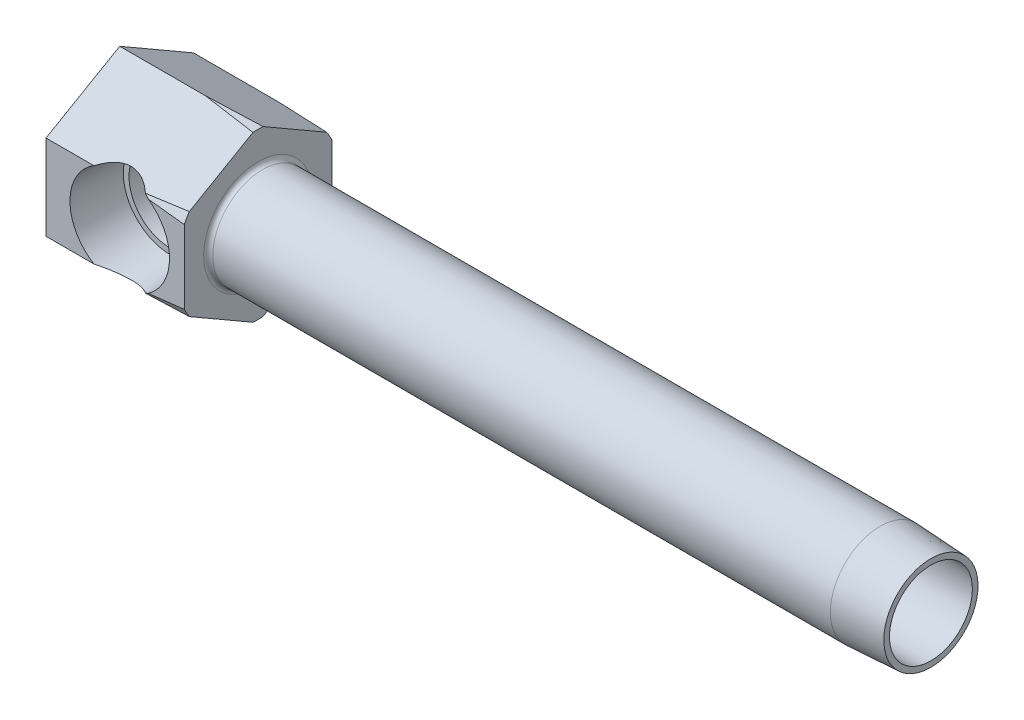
ISO-10303-21;
HEADER;
FILE_DESCRIPTION(('STEP AP214'),'2;1');
FILE_NAME('part.step','',(''),(''),'','','');
FILE_SCHEMA(('AUTOMOTIVE_DESIGN { 1 0 10303 214 1 1 1 1 }'));
ENDSEC;
DATA;
#1=APPLICATION_CONTEXT('core data for automotive mechanical design processes');
#2=APPLICATION_PROTOCOL_DEFINITION('international standard','automotive_design',2000,#1);
#3=PRODUCT_CONTEXT('',#1,'mechanical');
#4=PRODUCT('Part','Part','',(#3));
#5=PRODUCT_RELATED_PRODUCT_CATEGORY('part','',(#4));
#6=PRODUCT_DEFINITION_FORMATION('','',#4);
#7=PRODUCT_DEFINITION_CONTEXT('part definition',#1,'design');
#8=PRODUCT_DEFINITION('design','',#6,#7);
#9=PRODUCT_DEFINITION_SHAPE('','',#8);
#10=(LENGTH_UNIT() NAMED_UNIT(*) SI_UNIT(.MILLI.,.METRE.));
#11=(NAMED_UNIT(*) PLANE_ANGLE_UNIT() SI_UNIT($,.RADIAN.));
#12=(NAMED_UNIT(*) SI_UNIT($,.STERADIAN.) SOLID_ANGLE_UNIT());
#13=UNCERTAINTY_MEASURE_WITH_UNIT(LENGTH_MEASURE(1.E-05),#10,'distance_accuracy_value','');
#14=(GEOMETRIC_REPRESENTATION_CONTEXT(3) GLOBAL_UNCERTAINTY_ASSIGNED_CONTEXT((#13)) GLOBAL_UNIT_ASSIGNED_CONTEXT((#10,
#11,#12)) REPRESENTATION_CONTEXT('',''));
#15=CARTESIAN_POINT('',(0.,0.,0.));
#16=DIRECTION('',(0.,0.,1.));
#17=DIRECTION('',(1.,0.,0.));
#18=AXIS2_PLACEMENT_3D('',#15,#16,#17);
#19=CARTESIAN_POINT('',(139.7,0.,12.7));
#20=DIRECTION('',(-1.,0.,0.));
#21=DIRECTION('',(0.,-1.,0.));
#22=AXIS2_PLACEMENT_3D('',#19,#20,#21);
#23=CYLINDRICAL_SURFACE('',#22,8.5725);
#24=CARTESIAN_POINT('',(24.5999,0.,12.7));
#25=DIRECTION('',(-1.,0.,0.));
#26=DIRECTION('',(0.,-1.,0.));
#27=AXIS2_PLACEMENT_3D('',#24,#25,#26);
#28=CIRCLE('',#27,8.5725);
#29=CARTESIAN_POINT('',(24.5999,-8.57249999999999,12.7));
#30=VERTEX_POINT('',#29);
#31=EDGE_CURVE('E336',#30,#30,#28,.F.);
#32=ORIENTED_EDGE('',*,*,#31,.T.);
#33=EDGE_LOOP('',(#32));
#34=FACE_BOUND('',#33,.T.);
#35=CARTESIAN_POINT('',(130.9624,0.,12.7));
#36=DIRECTION('',(-1.,0.,0.));
#37=DIRECTION('',(0.,0.,1.));
#38=AXIS2_PLACEMENT_3D('',#35,#36,#37);
#39=CIRCLE('',#38,8.5725);
#40=CARTESIAN_POINT('',(130.9624,0.,21.2725));
#41=VERTEX_POINT('',#40);
#42=EDGE_CURVE('E451',#41,#41,#39,.T.);
#43=ORIENTED_EDGE('',*,*,#42,.T.);
#44=EDGE_LOOP('',(#43));
#45=FACE_BOUND('',#44,.T.);
#46=ADVANCED_FACE('F15',(#34,#45),#23,.T.);
#47=CARTESIAN_POINT('',(23.8125,14.6646968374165,12.7));
#48=DIRECTION('',(0.,-0.866025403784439,-0.5));
#49=DIRECTION('',(0.,0.5,-0.866025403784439));
#50=AXIS2_PLACEMENT_3D('',#47,#48,#49);
#51=PLANE('',#50);
#52=CARTESIAN_POINT('',(12.7,-0.84553451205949,39.56450873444));
#53=DIRECTION('',(0.,-0.866025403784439,-0.5));
#54=DIRECTION('',(0.,-0.5,0.866025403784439));
#55=AXIS2_PLACEMENT_3D('',#52,#53,#54);
#56=ELLIPSE('',#55,18.6296608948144,9.27637524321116);
#57=CARTESIAN_POINT('',(16.9206743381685,7.44928143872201,25.1974660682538));
#58=VERTEX_POINT('',#57);
#59=CARTESIAN_POINT('',(8.25878137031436,7.33234841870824,25.4));
#60=VERTEX_POINT('',#59);
#61=EDGE_CURVE('E274',#58,#60,#56,.F.);
#62=ORIENTED_EDGE('',*,*,#61,.F.);
#63=CARTESIAN_POINT('',(-18.0127594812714,5.8261682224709,28.0087806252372));
#64=CARTESIAN_POINT('',(-16.8306373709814,5.87521758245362,27.9238246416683));
#65=CARTESIAN_POINT('',(-15.6485840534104,5.92468080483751,27.8381518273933));
#66=CARTESIAN_POINT('',(-13.2846301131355,6.02451687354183,27.6652306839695));
#67=CARTESIAN_POINT('',(-12.1027294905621,6.07488972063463,27.5779823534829));
#68=CARTESIAN_POINT('',(-8.55724523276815,6.22749701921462,27.3136587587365));
#69=CARTESIAN_POINT('',(-6.19391632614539,6.33121869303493,27.1340075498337));
#70=CARTESIAN_POINT('',(-1.46820713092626,6.54348038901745,26.7663595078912));
#71=CARTESIAN_POINT('',(0.894173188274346,6.65202024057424,26.5783629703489));
#72=CARTESIAN_POINT('',(5.61779155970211,6.87509693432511,26.1919828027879));
#73=CARTESIAN_POINT('',(7.97902962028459,6.98963373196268,25.9935992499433));
#74=CARTESIAN_POINT('',(11.0687586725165,7.14461492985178,25.7251639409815));
#75=CARTESIAN_POINT('',(11.7979525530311,7.18156395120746,25.6611663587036));
#76=CARTESIAN_POINT('',(13.2561801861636,7.25627270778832,25.5317669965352));
#77=CARTESIAN_POINT('',(13.9852139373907,7.29403244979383,25.466365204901));
#78=CARTESIAN_POINT('',(16.2315552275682,7.41175284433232,25.2624675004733));
#79=CARTESIAN_POINT('',(17.7485574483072,7.49318264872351,25.1214269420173));
#80=CARTESIAN_POINT('',(20.0232678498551,7.61884388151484,24.903775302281));
#81=CARTESIAN_POINT('',(20.7813654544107,7.661316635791,24.8302103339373));
#82=CARTESIAN_POINT('',(22.2972664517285,7.74757966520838,24.6807983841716));
#83=CARTESIAN_POINT('',(23.0550698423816,7.79136994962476,24.6049513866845));
#84=CARTESIAN_POINT('',(25.0479048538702,7.90850103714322,24.4020743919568));
#85=CARTESIAN_POINT('',(26.2826492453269,7.98306924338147,24.2729184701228));
#86=CARTESIAN_POINT('',(28.7509106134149,8.13707342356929,24.0061754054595));
#87=CARTESIAN_POINT('',(29.9844276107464,8.2165093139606,23.8685884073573));
#88=CARTESIAN_POINT('',(31.8335368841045,8.34036536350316,23.6540634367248));
#89=CARTESIAN_POINT('',(32.4497586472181,8.38243776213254,23.5811919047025));
#90=CARTESIAN_POINT('',(33.681693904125,8.4683948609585,23.4323098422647));
#91=CARTESIAN_POINT('',(34.2974074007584,8.51227955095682,23.3562993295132));
#92=CARTESIAN_POINT('',(35.5282623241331,8.60215503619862,23.2006304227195));
#93=CARTESIAN_POINT('',(36.1434037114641,8.64814596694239,23.1209717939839));
#94=CARTESIAN_POINT('',(37.3729220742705,8.74265002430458,22.9572859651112));
#95=CARTESIAN_POINT('',(37.9872990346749,8.79116319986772,22.8732586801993));
#96=CARTESIAN_POINT('',(38.6012055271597,8.8411459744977,22.7866859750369));
#97=B_SPLINE_CURVE_WITH_KNOTS('',3,(#63,#64,#65,#66,#67,#68,#69,#70,#71,#72,#73,#74,#75,#76,#77,
#78,#79,#80,#81,#82,#83,#84,#85,#86,#87,#88,#89,#90,#91,#92,#93,#94,#95,#96),.UNSPECIFIED.,.F.,
.F.,(4,2,2,2,2,2,2,2,2,2,2,2,2,2,2,2,4),(0.,3.55855586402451,7.11711474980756,14.2343442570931,
21.3513219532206,28.4682467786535,30.667031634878,32.8658348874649,37.4429637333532,
39.7314856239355,42.0200236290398,45.751149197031,49.4822107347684,51.3480226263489,
53.2138240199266,55.0797456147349,56.9457034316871),.UNSPECIFIED.);
#98=CARTESIAN_POINT('',(23.8125,7.8358887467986,24.5278425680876));
#99=VERTEX_POINT('',#98);
#100=EDGE_CURVE('E349',#58,#99,#97,.T.);
#101=ORIENTED_EDGE('',*,*,#100,.T.);
#102=DIRECTION('',(0.,-0.5,0.866025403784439));
#103=VECTOR('',#102,1.);
#104=CARTESIAN_POINT('',(23.8125,14.6646968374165,12.7));
#105=LINE('',#104,#103);
#106=CARTESIAN_POINT('',(23.8125,14.1611565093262,13.5721574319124));
#107=VERTEX_POINT('',#106);
#108=EDGE_CURVE('E311',#107,#99,#105,.T.);
#109=ORIENTED_EDGE('',*,*,#108,.F.);
#110=CARTESIAN_POINT('',(38.0053136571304,13.203960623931,15.2300693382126));
#111=CARTESIAN_POINT('',(37.4159529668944,13.2510131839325,15.1485719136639));
#112=CARTESIAN_POINT('',(36.8261913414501,13.2967912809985,15.0692819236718));
#113=CARTESIAN_POINT('',(35.6460080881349,13.3861399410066,14.9145255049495));
#114=CARTESIAN_POINT('',(35.0555864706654,13.429710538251,14.8390590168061));
#115=CARTESIAN_POINT('',(33.8742386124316,13.5149847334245,14.691359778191));
#116=CARTESIAN_POINT('',(33.2833124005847,13.5566884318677,14.6191268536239));
#117=CARTESIAN_POINT('',(32.1010097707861,13.6384753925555,14.477467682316));
#118=CARTESIAN_POINT('',(31.5096333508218,13.6785586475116,14.4080414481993));
#119=CARTESIAN_POINT('',(29.735096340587,13.7966804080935,14.203448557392));
#120=CARTESIAN_POINT('',(28.5513716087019,13.8726020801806,14.0719483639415));
#121=CARTESIAN_POINT('',(26.1828060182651,14.0200015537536,13.8166449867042));
#122=CARTESIAN_POINT('',(24.9979651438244,14.091479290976,13.6928419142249));
#123=CARTESIAN_POINT('',(23.0550699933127,14.2056754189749,13.4950484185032));
#124=CARTESIAN_POINT('',(22.2972666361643,14.249465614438,13.4192015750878));
#125=CARTESIAN_POINT('',(20.7813650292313,14.335728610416,13.2697896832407));
#126=CARTESIAN_POINT('',(20.0232667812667,14.3782014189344,13.1962246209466));
#127=CARTESIAN_POINT('',(17.7485563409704,14.5038626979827,12.9785729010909));
#128=CARTESIAN_POINT('',(16.2315547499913,14.5852924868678,12.8375323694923));
#129=CARTESIAN_POINT('',(13.9256182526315,14.7061359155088,12.6282254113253));
#130=CARTESIAN_POINT('',(13.1369731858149,14.7469437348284,12.5575441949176));
#131=CARTESIAN_POINT('',(11.5594966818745,14.8276177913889,12.4178126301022));
#132=CARTESIAN_POINT('',(10.7706652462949,14.8674840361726,12.3487622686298));
#133=CARTESIAN_POINT('',(7.64137280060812,15.0239269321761,12.0777952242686));
#134=CARTESIAN_POINT('',(5.30024611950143,15.13718146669,11.8816326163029));
#135=CARTESIAN_POINT('',(0.616883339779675,15.3578521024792,11.4994198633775));
#136=CARTESIAN_POINT('',(-1.7253527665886,15.4652681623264,11.3133697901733));
#137=CARTESIAN_POINT('',(-6.41073890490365,15.6753958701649,10.949417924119));
#138=CARTESIAN_POINT('',(-8.75388896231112,15.7781073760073,10.7715163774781));
#139=CARTESIAN_POINT('',(-12.2690945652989,15.9292633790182,10.5097065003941));
#140=CARTESIAN_POINT('',(-13.4409010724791,15.9791631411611,10.423277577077));
#141=CARTESIAN_POINT('',(-15.784663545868,16.0780718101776,10.2519627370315));
#142=CARTESIAN_POINT('',(-16.9566195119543,16.1270807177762,10.1670768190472));
#143=CARTESIAN_POINT('',(-18.1286428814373,16.1756838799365,10.0828936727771));
#144=B_SPLINE_CURVE_WITH_KNOTS('',3,(#110,#111,#112,#113,#114,#115,#116,#117,#118,#119,#120,
#121,#122,#123,#124,#125,#126,#127,#128,#129,#130,#131,#132,#133,#134,#135,#136,#137,#138,#139,
#140,#141,#142,#143),.UNSPECIFIED.,.F.,.F.,(4,2,2,2,2,2,2,2,2,2,2,2,2,2,2,2,4),(0.,
1.7904650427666,3.58090225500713,5.3712429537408,7.16159170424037,10.7418152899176,
14.3220906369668,16.6106283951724,18.8991522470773,23.4762793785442,25.8548487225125,
28.233399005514,35.2895314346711,42.345713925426,49.4021094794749,52.9302543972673,
56.4583964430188),.UNSPECIFIED.);
#145=CARTESIAN_POINT('',(14.7163594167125,14.6646968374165,12.7));
#146=VERTEX_POINT('',#145);
#147=EDGE_CURVE('E422',#107,#146,#144,.T.);
#148=ORIENTED_EDGE('',*,*,#147,.T.);
#149=DIRECTION('',(-1.,0.,0.));
#150=VECTOR('',#149,1.);
#151=CARTESIAN_POINT('',(23.8125,14.6646968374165,12.7));
#152=LINE('',#151,#150);
#153=CARTESIAN_POINT('',(0.,14.6646968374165,12.7));
#154=VERTEX_POINT('',#153);
#155=EDGE_CURVE('E327',#146,#154,#152,.T.);
#156=ORIENTED_EDGE('',*,*,#155,.T.);
#157=DIRECTION('',(0.,-0.5,0.866025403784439));
#158=VECTOR('',#157,1.);
#159=CARTESIAN_POINT('',(0.,14.6646968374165,12.7));
#160=LINE('',#159,#158);
#161=CARTESIAN_POINT('',(0.,7.33234841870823,25.4));
#162=VERTEX_POINT('',#161);
#163=EDGE_CURVE('E289',#154,#162,#160,.T.);
#164=ORIENTED_EDGE('',*,*,#163,.T.);
#165=DIRECTION('',(-1.,0.,0.));
#166=VECTOR('',#165,1.);
#167=CARTESIAN_POINT('',(23.8125,7.33234841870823,25.4));
#168=LINE('',#167,#166);
#169=EDGE_CURVE('E325',#60,#162,#168,.T.);
#170=ORIENTED_EDGE('',*,*,#169,.F.);
#171=EDGE_LOOP('',(#62,#101,#109,#148,#156,#164,#170));
#172=FACE_BOUND('',#171,.T.);
#173=ADVANCED_FACE('F222',(#172),#51,.F.);
#174=CARTESIAN_POINT('',(23.8125,7.33234841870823,25.4));
#175=DIRECTION('',(0.,0.,-1.));
#176=DIRECTION('',(-1.,0.,0.));
#177=AXIS2_PLACEMENT_3D('',#174,#175,#176);
#178=PLANE('',#177);
#179=CARTESIAN_POINT('',(12.7,0.,25.4));
#180=DIRECTION('',(0.,0.,-1.));
#181=DIRECTION('',(-1.,0.,0.));
#182=AXIS2_PLACEMENT_3D('',#179,#180,#181);
#183=CIRCLE('',#182,8.5725);
#184=CARTESIAN_POINT('',(17.6149503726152,7.02360442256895,25.4));
#185=VERTEX_POINT('',#184);
#186=CARTESIAN_POINT('',(17.6149503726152,-7.02360442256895,25.4));
#187=VERTEX_POINT('',#186);
#188=EDGE_CURVE('E263',#185,#187,#183,.T.);
#189=ORIENTED_EDGE('',*,*,#188,.T.);
#190=CARTESIAN_POINT('',(-8.3295154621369,-9.52079934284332,25.4));
#191=CARTESIAN_POINT('',(-7.18977900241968,-9.42121599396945,25.4));
#192=CARTESIAN_POINT('',(-6.05012874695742,-9.32064776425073,25.4));
#193=CARTESIAN_POINT('',(-3.77102236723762,-9.11732322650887,25.4));
#194=CARTESIAN_POINT('',(-2.63156624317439,-9.01456691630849,25.4));
#195=CARTESIAN_POINT('',(0.786306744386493,-8.70270403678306,25.4));
#196=CARTESIAN_POINT('',(3.06439648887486,-8.48998888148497,25.4));
#197=CARTESIAN_POINT('',(7.61793671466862,-8.0527124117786,25.4));
#198=CARTESIAN_POINT('',(9.89338794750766,-7.82815894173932,25.4));
#199=CARTESIAN_POINT('',(14.4429226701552,-7.36367870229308,25.4));
#200=CARTESIAN_POINT('',(16.7170060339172,-7.12375068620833,25.4));
#201=CARTESIAN_POINT('',(20.1274799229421,-6.74821527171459,25.4));
#202=CARTESIAN_POINT('',(21.2647249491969,-6.62036644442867,25.4));
#203=CARTESIAN_POINT('',(23.5384915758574,-6.35848523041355,25.4));
#204=CARTESIAN_POINT('',(24.6750131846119,-6.22445291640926,25.4));
#205=CARTESIAN_POINT('',(26.9469312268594,-5.94896237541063,25.4));
#206=CARTESIAN_POINT('',(28.0823278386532,-5.80750562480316,25.4));
#207=CARTESIAN_POINT('',(30.351986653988,-5.51536615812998,25.4));
#208=CARTESIAN_POINT('',(31.4862488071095,-5.36468304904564,25.4));
#209=CARTESIAN_POINT('',(33.754066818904,-5.05146142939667,25.4));
#210=CARTESIAN_POINT('',(34.8876214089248,-4.8889136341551,25.4));
#211=CARTESIAN_POINT('',(36.5861129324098,-4.63330979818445,25.4));
#212=CARTESIAN_POINT('',(37.1519375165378,-4.54615018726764,25.4));
#213=CARTESIAN_POINT('',(38.2828599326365,-4.36715952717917,25.4));
#214=CARTESIAN_POINT('',(38.847957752,-4.27532839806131,25.4));
#215=CARTESIAN_POINT('',(39.97760355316,-4.08599293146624,25.4));
#216=CARTESIAN_POINT('',(40.542150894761,-3.98848475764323,25.4));
#217=CARTESIAN_POINT('',(41.6699834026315,-3.78654728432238,25.4));
#218=CARTESIAN_POINT('',(42.2332686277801,-3.68211831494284,25.4));
#219=CARTESIAN_POINT('',(43.3583746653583,-3.46442554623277,25.4));
#220=CARTESIAN_POINT('',(43.9201948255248,-3.35115833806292,25.4));
#221=CARTESIAN_POINT('',(44.7611051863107,-3.1724631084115,25.4));
#222=CARTESIAN_POINT('',(45.0411277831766,-3.11142703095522,25.4));
#223=CARTESIAN_POINT('',(45.600396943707,-2.98584590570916,25.4));
#224=CARTESIAN_POINT('',(45.8796434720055,-2.92130070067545,25.4));
#225=CARTESIAN_POINT('',(46.1584123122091,-2.85471375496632,25.4));
#226=B_SPLINE_CURVE_WITH_KNOTS('',3,(#190,#191,#192,#193,#194,#195,#196,#197,#198,#199,#200,
#201,#202,#203,#204,#205,#206,#207,#208,#209,#210,#211,#212,#213,#214,#215,#216,#217,#218,#219,
#220,#221,#222,#223,#224,#225),.UNSPECIFIED.,.F.,.F.,(4,2,2,2,2,2,2,2,2,2,2,2,2,2,2,2,2,4),(0.,
3.43223509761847,6.86447361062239,13.7284439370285,20.5879218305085,27.4479566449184,
30.8811699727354,34.3143429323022,37.746835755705,41.179474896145,44.6148296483,
46.3323092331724,48.0498182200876,49.7685016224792,51.4871031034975,53.2063707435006,
54.0661429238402,54.9259536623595),.UNSPECIFIED.);
#227=CARTESIAN_POINT('',(23.8125,-6.32526776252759,25.4));
#228=VERTEX_POINT('',#227);
#229=EDGE_CURVE('E265',#187,#228,#226,.T.);
#230=ORIENTED_EDGE('',*,*,#229,.T.);
#231=DIRECTION('',(0.,-1.,0.));
#232=VECTOR('',#231,1.);
#233=CARTESIAN_POINT('',(23.8125,7.33234841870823,25.4));
#234=LINE('',#233,#232);
#235=CARTESIAN_POINT('',(23.8125,6.32526776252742,25.4));
#236=VERTEX_POINT('',#235);
#237=EDGE_CURVE('E314',#236,#228,#234,.T.);
#238=ORIENTED_EDGE('',*,*,#237,.F.);
#239=CARTESIAN_POINT('',(46.1584123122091,2.85471375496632,25.4));
#240=CARTESIAN_POINT('',(45.8796434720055,2.92130070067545,25.4));
#241=CARTESIAN_POINT('',(45.600396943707,2.98584590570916,25.4));
#242=CARTESIAN_POINT('',(45.0411277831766,3.11142703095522,25.4));
#243=CARTESIAN_POINT('',(44.7611051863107,3.1724631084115,25.4));
#244=CARTESIAN_POINT('',(43.9201948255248,3.35115833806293,25.4));
#245=CARTESIAN_POINT('',(43.3583746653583,3.46442554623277,25.4));
#246=CARTESIAN_POINT('',(42.2332686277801,3.68211831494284,25.4));
#247=CARTESIAN_POINT('',(41.6699834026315,3.78654728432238,25.4));
#248=CARTESIAN_POINT('',(40.542150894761,3.98848475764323,25.4));
#249=CARTESIAN_POINT('',(39.97760355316,4.08599293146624,25.4));
#250=CARTESIAN_POINT('',(38.847957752,4.27532839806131,25.4));
#251=CARTESIAN_POINT('',(38.2828599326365,4.36715952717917,25.4));
#252=CARTESIAN_POINT('',(37.1519375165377,4.54615018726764,25.4));
#253=CARTESIAN_POINT('',(36.5861129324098,4.63330979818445,25.4));
#254=CARTESIAN_POINT('',(34.8876214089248,4.8889136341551,25.4));
#255=CARTESIAN_POINT('',(33.754066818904,5.05146142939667,25.4));
#256=CARTESIAN_POINT('',(31.4862488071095,5.36468304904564,25.4));
#257=CARTESIAN_POINT('',(30.3519866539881,5.51536615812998,25.4));
#258=CARTESIAN_POINT('',(28.0823278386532,5.80750562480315,25.4));
#259=CARTESIAN_POINT('',(26.9469312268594,5.94896237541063,25.4));
#260=CARTESIAN_POINT('',(24.6750131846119,6.22445291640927,25.4));
#261=CARTESIAN_POINT('',(23.5384915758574,6.35848523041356,25.4));
#262=CARTESIAN_POINT('',(21.2647249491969,6.62036644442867,25.4));
#263=CARTESIAN_POINT('',(20.1274799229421,6.74821527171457,25.4));
#264=CARTESIAN_POINT('',(16.7170060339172,7.1237506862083,25.4));
#265=CARTESIAN_POINT('',(14.4429226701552,7.36367870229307,25.4));
#266=CARTESIAN_POINT('',(9.89338794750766,7.82815894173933,25.4));
#267=CARTESIAN_POINT('',(7.61793671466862,8.0527124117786,25.4));
#268=CARTESIAN_POINT('',(3.06439648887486,8.48998888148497,25.4));
#269=CARTESIAN_POINT('',(0.786306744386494,8.70270403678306,25.4));
#270=CARTESIAN_POINT('',(-2.63156624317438,9.01456691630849,25.4));
#271=CARTESIAN_POINT('',(-3.77102236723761,9.11732322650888,25.4));
#272=CARTESIAN_POINT('',(-6.05012874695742,9.32064776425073,25.4));
#273=CARTESIAN_POINT('',(-7.18977900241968,9.42121599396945,25.4));
#274=CARTESIAN_POINT('',(-8.3295154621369,9.52079934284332,25.4));
#275=B_SPLINE_CURVE_WITH_KNOTS('',3,(#239,#240,#241,#242,#243,#244,#245,#246,#247,#248,#249,
#250,#251,#252,#253,#254,#255,#256,#257,#258,#259,#260,#261,#262,#263,#264,#265,#266,#267,#268,
#269,#270,#271,#272,#273,#274),.UNSPECIFIED.,.F.,.F.,(4,2,2,2,2,2,2,2,2,2,2,2,2,2,2,2,2,4),(0.,
0.859810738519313,1.71958291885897,3.438850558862,5.15745203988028,6.87613544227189,
8.59364442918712,10.3111240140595,13.7464787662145,17.1791179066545,20.6116107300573,
24.0447836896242,27.4779970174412,34.338031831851,41.197509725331,48.0614800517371,
51.4937185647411,54.9259536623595),.UNSPECIFIED.);
#276=EDGE_CURVE('E176',#236,#185,#275,.T.);
#277=ORIENTED_EDGE('',*,*,#276,.T.);
#278=EDGE_LOOP('',(#189,#230,#238,#277));
#279=FACE_BOUND('',#278,.T.);
#280=ADVANCED_FACE('F246',(#279),#178,.F.);
#281=CARTESIAN_POINT('',(8.25878137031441,-7.33234841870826,25.4));
#282=VERTEX_POINT('',#281);
#283=EDGE_CURVE('E270',#282,#60,#183,.T.);
#284=ORIENTED_EDGE('',*,*,#283,.T.);
#285=ORIENTED_EDGE('',*,*,#169,.T.);
#286=DIRECTION('',(0.,-1.,0.));
#287=VECTOR('',#286,1.);
#288=CARTESIAN_POINT('',(0.,7.33234841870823,25.4));
#289=LINE('',#288,#287);
#290=CARTESIAN_POINT('',(0.,-7.33234841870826,25.4));
#291=VERTEX_POINT('',#290);
#292=EDGE_CURVE('E293',#162,#291,#289,.T.);
#293=ORIENTED_EDGE('',*,*,#292,.T.);
#294=DIRECTION('',(-1.,0.,0.));
#295=VECTOR('',#294,1.);
#296=CARTESIAN_POINT('',(23.8125,-7.33234841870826,25.4));
#297=LINE('',#296,#295);
#298=EDGE_CURVE('E323',#282,#291,#297,.T.);
#299=ORIENTED_EDGE('',*,*,#298,.F.);
#300=EDGE_LOOP('',(#284,#285,#293,#299));
#301=FACE_BOUND('',#300,.T.);
#302=ADVANCED_FACE('F249',(#301),#178,.F.);
#303=CARTESIAN_POINT('',(23.8125,-7.33234841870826,25.4));
#304=DIRECTION('',(0.,0.86602540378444,-0.5));
#305=DIRECTION('',(0.,0.5,0.86602540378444));
#306=AXIS2_PLACEMENT_3D('',#303,#304,#305);
#307=PLANE('',#306);
#308=DIRECTION('',(-1.,0.,0.));
#309=VECTOR('',#308,1.);
#310=CARTESIAN_POINT('',(23.8125,-14.6646968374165,12.7));
#311=LINE('',#310,#309);
#312=CARTESIAN_POINT('',(14.7163594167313,-14.6646968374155,12.6999999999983));
#313=VERTEX_POINT('',#312);
#314=CARTESIAN_POINT('',(0.,-14.6646968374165,12.7));
#315=VERTEX_POINT('',#314);
#316=EDGE_CURVE('E319',#313,#315,#311,.T.);
#317=ORIENTED_EDGE('',*,*,#316,.F.);
#318=CARTESIAN_POINT('',(-18.1286428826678,-16.1756838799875,10.0828936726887));
#319=CARTESIAN_POINT('',(-16.9566195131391,-16.1270807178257,10.1670768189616));
#320=CARTESIAN_POINT('',(-15.7846635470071,-16.0780718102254,10.2519627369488));
#321=CARTESIAN_POINT('',(-13.4409010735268,-15.9791631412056,10.423277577));
#322=CARTESIAN_POINT('',(-12.269094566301,-15.929263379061,10.50970650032));
#323=CARTESIAN_POINT('',(-8.75388896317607,-15.778107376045,10.7715163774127));
#324=CARTESIAN_POINT('',(-6.41073890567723,-15.6753958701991,10.9494179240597));
#325=CARTESIAN_POINT('',(-1.72535276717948,-15.4652681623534,11.3133697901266));
#326=CARTESIAN_POINT('',(0.616883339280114,-15.3578521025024,11.4994198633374));
#327=CARTESIAN_POINT('',(5.30024611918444,-15.1371814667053,11.8816326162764));
#328=CARTESIAN_POINT('',(7.64137280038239,-15.0239269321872,12.0777952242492));
#329=CARTESIAN_POINT('',(10.7706652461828,-14.8674840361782,12.34876226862));
#330=CARTESIAN_POINT('',(11.5594966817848,-14.8276177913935,12.4178126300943));
#331=CARTESIAN_POINT('',(13.13697318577,-14.7469437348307,12.5575441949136));
#332=CARTESIAN_POINT('',(13.9256182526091,-14.70613591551,12.6282254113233));
#333=CARTESIAN_POINT('',(16.2315547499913,-14.5852924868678,12.8375323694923));
#334=CARTESIAN_POINT('',(17.7485563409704,-14.5038626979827,12.9785729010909));
#335=CARTESIAN_POINT('',(20.0232667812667,-14.3782014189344,13.1962246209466));
#336=CARTESIAN_POINT('',(20.7813650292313,-14.335728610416,13.2697896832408));
#337=CARTESIAN_POINT('',(22.2972666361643,-14.249465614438,13.4192015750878));
#338=CARTESIAN_POINT('',(23.0550699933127,-14.2056754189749,13.4950484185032));
#339=CARTESIAN_POINT('',(24.9979651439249,-14.0914792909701,13.6928419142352));
#340=CARTESIAN_POINT('',(26.1828060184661,-14.0200015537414,13.8166449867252));
#341=CARTESIAN_POINT('',(28.5513716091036,-13.8726020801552,14.0719483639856));
#342=CARTESIAN_POINT('',(29.735096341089,-13.796680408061,14.2034485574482));
#343=CARTESIAN_POINT('',(31.5096333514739,-13.6785586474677,14.4080414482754));
#344=CARTESIAN_POINT('',(32.1010097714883,-13.6384753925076,14.477467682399));
#345=CARTESIAN_POINT('',(33.2833124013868,-13.5566884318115,14.6191268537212));
#346=CARTESIAN_POINT('',(33.8742386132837,-13.514984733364,14.6913597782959));
#347=CARTESIAN_POINT('',(35.0555864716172,-13.4297105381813,14.8390590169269));
#348=CARTESIAN_POINT('',(35.6460080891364,-13.3861399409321,14.9145255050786));
#349=CARTESIAN_POINT('',(36.826191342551,-13.2967912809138,15.0692819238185));
#350=CARTESIAN_POINT('',(37.4159529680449,-13.2510131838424,15.14857191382));
#351=CARTESIAN_POINT('',(38.0053136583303,-13.2039606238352,15.2300693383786));
#352=B_SPLINE_CURVE_WITH_KNOTS('',3,(#318,#319,#320,#321,#322,#323,#324,#325,#326,#327,#328,
#329,#330,#331,#332,#333,#334,#335,#336,#337,#338,#339,#340,#341,#342,#343,#344,#345,#346,#347,
#348,#349,#350,#351),.UNSPECIFIED.,.F.,.F.,(4,2,2,2,2,2,2,2,2,2,2,2,2,2,2,2,4),(0.,
3.52814204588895,7.05628696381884,14.1126825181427,21.1688650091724,28.2249974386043,
30.6035477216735,32.9821170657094,37.5592441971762,39.8477680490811,42.1363058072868,
45.7165811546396,49.2968047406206,51.0871534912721,52.8774941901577,54.6679314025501,
56.4583964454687),.UNSPECIFIED.);
#353=CARTESIAN_POINT('',(23.8125,-14.1611565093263,13.5721574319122));
#354=VERTEX_POINT('',#353);
#355=EDGE_CURVE('E410',#313,#354,#352,.T.);
#356=ORIENTED_EDGE('',*,*,#355,.T.);
#357=DIRECTION('',(0.,-0.5,-0.86602540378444));
#358=VECTOR('',#357,1.);
#359=CARTESIAN_POINT('',(23.8125,-7.33234841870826,25.4));
#360=LINE('',#359,#358);
#361=CARTESIAN_POINT('',(23.8125,-7.83588874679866,24.5278425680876));
#362=VERTEX_POINT('',#361);
#363=EDGE_CURVE('E316',#362,#354,#360,.T.);
#364=ORIENTED_EDGE('',*,*,#363,.F.);
#365=CARTESIAN_POINT('',(38.6012055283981,-8.84114597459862,22.7866859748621));
#366=CARTESIAN_POINT('',(37.9873005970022,-8.79116332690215,22.8732584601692));
#367=CARTESIAN_POINT('',(37.3729251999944,-8.74265027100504,22.9572855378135));
#368=CARTESIAN_POINT('',(36.1434099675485,-8.64814644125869,23.120970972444));
#369=CARTESIAN_POINT('',(35.5282701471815,-8.60215561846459,23.2006294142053));
#370=CARTESIAN_POINT('',(34.2974183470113,-8.51228033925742,23.3562979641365));
#371=CARTESIAN_POINT('',(33.6817064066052,-8.46839574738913,23.4323083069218));
#372=CARTESIAN_POINT('',(32.4497742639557,-8.38243883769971,23.5811900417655));
#373=CARTESIAN_POINT('',(31.8335540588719,-8.3403665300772,23.6540614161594));
#374=CARTESIAN_POINT('',(29.9844432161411,-8.21651032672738,23.8685866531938));
#375=CARTESIAN_POINT('',(28.7509230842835,-8.13707421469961,24.0061740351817));
#376=CARTESIAN_POINT('',(26.2826554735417,-7.98306961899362,24.2729178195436));
#377=CARTESIAN_POINT('',(25.0479079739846,-7.90850121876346,24.4020740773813));
#378=CARTESIAN_POINT('',(23.0550679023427,-7.7913698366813,24.6049515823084));
#379=CARTESIAN_POINT('',(22.2972625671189,-7.74757944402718,24.6807987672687));
#380=CARTESIAN_POINT('',(20.7813576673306,-7.66131619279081,24.8302111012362));
#381=CARTESIAN_POINT('',(20.0232581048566,-7.61884332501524,24.9037762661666));
#382=CARTESIAN_POINT('',(17.7485495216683,-7.49318224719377,25.1214276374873));
#383=CARTESIAN_POINT('',(16.2315508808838,-7.4117527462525,25.2624676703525));
#384=CARTESIAN_POINT('',(14.2391996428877,-7.30734262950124,25.4433112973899));
#385=CARTESIAN_POINT('',(13.7642043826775,-7.28263941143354,25.4860985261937));
#386=CARTESIAN_POINT('',(12.3060948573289,-7.20735733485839,25.6164909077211));
#387=CARTESIAN_POINT('',(11.3228600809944,-7.15736070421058,25.7030876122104));
#388=CARTESIAN_POINT('',(7.97897271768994,-6.98963083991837,25.993604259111));
#389=CARTESIAN_POINT('',(5.61767875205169,-6.87509145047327,26.1919923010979));
#390=CARTESIAN_POINT('',(0.893948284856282,-6.65200977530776,26.5783810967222));
#391=CARTESIAN_POINT('',(-1.4684882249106,-6.54346753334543,26.7663817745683));
#392=CARTESIAN_POINT('',(-6.19419730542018,-6.33120630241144,27.1340290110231));
#393=CARTESIAN_POINT('',(-8.55746986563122,-6.22748725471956,27.3136756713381));
#394=CARTESIAN_POINT('',(-12.1028697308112,-6.07488373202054,27.5779927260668));
#395=CARTESIAN_POINT('',(-13.2847423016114,-6.02451211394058,27.6652389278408));
#396=CARTESIAN_POINT('',(-15.6486401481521,-5.92467845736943,27.8381558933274));
#397=CARTESIAN_POINT('',(-16.8306654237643,-5.87521641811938,27.9238266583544));
#398=CARTESIAN_POINT('',(-18.0127594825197,-5.82616822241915,28.0087806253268));
#399=B_SPLINE_CURVE_WITH_KNOTS('',3,(#365,#366,#367,#368,#369,#370,#371,#372,#373,#374,#375,
#376,#377,#378,#379,#380,#381,#382,#383,#384,#385,#386,#387,#388,#389,#390,#391,#392,#393,#394,
#395,#396,#397,#398),.UNSPECIFIED.,.F.,.F.,(4,2,2,2,2,2,2,2,2,2,2,2,2,2,2,2,4),(0.,
1.8659530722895,3.73186992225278,5.5976666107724,7.46347379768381,11.1945448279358,
14.925679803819,17.2142236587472,19.5027515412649,24.0798685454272,25.5125419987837,
28.4774563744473,35.5945509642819,42.7116974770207,49.8287573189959,53.3872317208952,
56.9457031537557),.UNSPECIFIED.);
#400=CARTESIAN_POINT('',(16.9206743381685,-7.449281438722,25.1974660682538));
#401=VERTEX_POINT('',#400);
#402=EDGE_CURVE('E360',#362,#401,#399,.T.);
#403=ORIENTED_EDGE('',*,*,#402,.T.);
#404=CARTESIAN_POINT('',(12.7,0.845534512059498,39.5645087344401));
#405=DIRECTION('',(0.,0.86602540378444,-0.5));
#406=DIRECTION('',(0.,0.5,0.86602540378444));
#407=AXIS2_PLACEMENT_3D('',#404,#405,#406);
#408=ELLIPSE('',#407,18.6296608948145,9.27637524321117);
#409=EDGE_CURVE('E339',#282,#401,#408,.F.);
#410=ORIENTED_EDGE('',*,*,#409,.F.);
#411=ORIENTED_EDGE('',*,*,#298,.T.);
#412=DIRECTION('',(0.,-0.5,-0.86602540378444));
#413=VECTOR('',#412,1.);
#414=CARTESIAN_POINT('',(0.,-7.33234841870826,25.4));
#415=LINE('',#414,#413);
#416=EDGE_CURVE('E297',#291,#315,#415,.T.);
#417=ORIENTED_EDGE('',*,*,#416,.T.);
#418=EDGE_LOOP('',(#317,#356,#364,#403,#410,#411,#417));
#419=FACE_BOUND('',#418,.T.);
#420=ADVANCED_FACE('F236',(#419),#307,.F.);
#421=CARTESIAN_POINT('',(23.8125,-14.6646968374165,12.7));
#422=DIRECTION('',(0.,0.866025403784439,0.5));
#423=DIRECTION('',(0.,-0.5,0.866025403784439));
#424=AXIS2_PLACEMENT_3D('',#421,#422,#423);
#425=PLANE('',#424);
#426=DIRECTION('',(-1.,0.,0.));
#427=VECTOR('',#426,1.);
#428=CARTESIAN_POINT('',(23.8125,-7.33234841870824,0.));
#429=LINE('',#428,#427);
#430=CARTESIAN_POINT('',(14.7163594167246,-7.33234841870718,0.));
#431=VERTEX_POINT('',#430);
#432=CARTESIAN_POINT('',(0.,-7.33234841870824,0.));
#433=VERTEX_POINT('',#432);
#434=EDGE_CURVE('E331',#431,#433,#429,.T.);
#435=ORIENTED_EDGE('',*,*,#434,.F.);
#436=CARTESIAN_POINT('',(-17.7512299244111,-5.83702636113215,-2.58997377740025));
#437=CARTESIAN_POINT('',(-16.5800155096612,-5.88568459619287,-2.50569524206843));
#438=CARTESIAN_POINT('',(-15.4088691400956,-5.93475168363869,-2.42070855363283));
#439=CARTESIAN_POINT('',(-13.0667273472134,-6.03378392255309,-2.2491796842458));
#440=CARTESIAN_POINT('',(-11.8957319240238,-6.08374907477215,-2.16263750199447));
#441=CARTESIAN_POINT('',(-8.38296125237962,-6.23511359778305,-1.90046645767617));
#442=CARTESIAN_POINT('',(-6.04143765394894,-6.33798054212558,-1.72229568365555));
#443=CARTESIAN_POINT('',(-1.35932396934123,-6.54846296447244,-1.3577294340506));
#444=CARTESIAN_POINT('',(0.981266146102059,-6.6560782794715,-1.1713342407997));
#445=CARTESIAN_POINT('',(5.66132200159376,-6.87720942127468,-0.788323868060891));
#446=CARTESIAN_POINT('',(8.00078774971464,-6.99072520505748,-0.591708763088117));
#447=CARTESIAN_POINT('',(11.0687587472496,-7.14461490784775,-0.325163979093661));
#448=CARTESIAN_POINT('',(11.7979526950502,-7.1815639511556,-0.261166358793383));
#449=CARTESIAN_POINT('',(13.2561803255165,-7.25627272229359,-0.131766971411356));
#450=CARTESIAN_POINT('',(13.9852140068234,-7.29403245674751,-0.0663651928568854));
#451=CARTESIAN_POINT('',(16.2315548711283,-7.41175281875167,0.137532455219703));
#452=CARTESIAN_POINT('',(17.7485567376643,-7.49318259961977,0.278572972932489));
#453=CARTESIAN_POINT('',(20.0232671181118,-7.61884384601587,0.49622463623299));
#454=CARTESIAN_POINT('',(20.7813650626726,-7.66131662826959,0.569789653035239));
#455=CARTESIAN_POINT('',(22.2972664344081,-7.74757964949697,0.719201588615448));
#456=CARTESIAN_POINT('',(23.055069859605,-7.79136989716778,0.795048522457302));
#457=CARTESIAN_POINT('',(25.0261555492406,-7.90722278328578,0.995711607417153));
#458=CARTESIAN_POINT('',(26.2391665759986,-7.98044428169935,1.12253496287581));
#459=CARTESIAN_POINT('',(28.6640105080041,-8.13156769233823,1.38428838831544));
#460=CARTESIAN_POINT('',(29.8758434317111,-8.20946952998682,1.51921832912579));
#461=CARTESIAN_POINT('',(31.6924781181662,-8.330818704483,1.72940126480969));
#462=CARTESIAN_POINT('',(32.2978802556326,-8.37202092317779,1.80076560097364));
#463=CARTESIAN_POINT('',(33.5082022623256,-8.4561520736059,1.94648502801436));
#464=CARTESIAN_POINT('',(34.1131221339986,-8.49908099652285,2.02084010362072));
#465=CARTESIAN_POINT('',(35.3224200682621,-8.58693780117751,2.17301255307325));
#466=CARTESIAN_POINT('',(35.9267980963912,-8.63186580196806,2.25083013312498));
#467=CARTESIAN_POINT('',(37.1348369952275,-8.72410227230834,2.41058838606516));
#468=CARTESIAN_POINT('',(37.7384978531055,-8.77141078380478,2.49252913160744));
#469=CARTESIAN_POINT('',(38.3417198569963,-8.82010071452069,2.57686256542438));
#470=B_SPLINE_CURVE_WITH_KNOTS('',3,(#436,#437,#438,#439,#440,#441,#442,#443,#444,#445,#446,
#447,#448,#449,#450,#451,#452,#453,#454,#455,#456,#457,#458,#459,#460,#461,#462,#463,#464,#465,
#466,#467,#468,#469),.UNSPECIFIED.,.F.,.F.,(4,2,2,2,2,2,2,2,2,2,2,2,2,2,2,2,4),(0.,
3.52575082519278,7.0515045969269,14.1031206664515,21.1544948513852,28.2058176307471,
30.4046026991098,32.6034057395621,37.1805335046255,39.4690564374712,41.757594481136,
45.4230230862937,49.0883933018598,50.9213391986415,52.7542757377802,54.5873215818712,
56.4203997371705),.UNSPECIFIED.);
#471=CARTESIAN_POINT('',(23.8125,-7.83588874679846,0.872157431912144));
#472=VERTEX_POINT('',#471);
#473=EDGE_CURVE('E389',#431,#472,#470,.T.);
#474=ORIENTED_EDGE('',*,*,#473,.T.);
#475=DIRECTION('',(0.,0.5,-0.866025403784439));
#476=VECTOR('',#475,1.);
#477=CARTESIAN_POINT('',(23.8125,-14.6646968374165,12.7));
#478=LINE('',#477,#476);
#479=CARTESIAN_POINT('',(23.8125,-14.1611565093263,11.8278425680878));
#480=VERTEX_POINT('',#479);
#481=EDGE_CURVE('E301',#480,#472,#478,.T.);
#482=ORIENTED_EDGE('',*,*,#481,.F.);
#483=CARTESIAN_POINT('',(38.2458455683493,-13.1846744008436,10.1365259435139));
#484=CARTESIAN_POINT('',(37.6465742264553,-13.232893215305,10.2200433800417));
#485=CARTESIAN_POINT('',(37.0468751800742,-13.2797619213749,10.3012223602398));
#486=CARTESIAN_POINT('',(35.8467766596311,-13.371169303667,10.4595445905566));
#487=CARTESIAN_POINT('',(35.2463771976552,-13.4157080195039,10.53668790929));
#488=CARTESIAN_POINT('',(34.045047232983,-13.502824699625,10.6875784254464));
#489=CARTESIAN_POINT('',(33.4441167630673,-13.5454027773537,10.7613258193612));
#490=CARTESIAN_POINT('',(32.2417828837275,-13.6288630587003,10.9058832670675));
#491=CARTESIAN_POINT('',(31.6403794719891,-13.6697452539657,10.9766933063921));
#492=CARTESIAN_POINT('',(29.8357415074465,-13.7901721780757,11.18527885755));
#493=CARTESIAN_POINT('',(28.6319170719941,-13.8675088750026,11.3192299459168));
#494=CARTESIAN_POINT('',(26.2231080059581,-14.0175700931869,11.5791436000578));
#495=CARTESIAN_POINT('',(25.0181233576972,-14.0902945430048,11.7051060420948));
#496=CARTESIAN_POINT('',(23.055068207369,-14.2056754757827,11.9049516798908));
#497=CARTESIAN_POINT('',(22.2972631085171,-14.2494658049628,11.980798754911));
#498=CARTESIAN_POINT('',(20.7813582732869,-14.3357290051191,12.1302110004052));
#499=CARTESIAN_POINT('',(20.0232585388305,-14.3782018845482,12.2037761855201));
#500=CARTESIAN_POINT('',(17.7485497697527,-14.5038630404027,12.4214276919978));
#501=CARTESIAN_POINT('',(16.231551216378,-14.5852926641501,12.5624679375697));
#502=CARTESIAN_POINT('',(14.1084826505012,-14.6965528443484,12.7551762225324));
#503=CARTESIAN_POINT('',(13.502746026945,-14.7279890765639,12.8096253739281));
#504=CARTESIAN_POINT('',(11.9253601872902,-14.8091045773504,12.9501215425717));
#505=CARTESIAN_POINT('',(10.9536190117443,-14.8583376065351,13.0353956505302));
#506=CARTESIAN_POINT('',(7.6211548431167,-15.0249377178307,13.3239555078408));
#507=CARTESIAN_POINT('',(5.25979802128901,-15.1391384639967,13.5217570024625));
#508=CARTESIAN_POINT('',(0.535958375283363,-15.3616127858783,13.9070938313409));
#509=CARTESIAN_POINT('',(-1.82652445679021,-15.4698863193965,14.0946290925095));
#510=CARTESIAN_POINT('',(-6.55231374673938,-15.6816600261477,14.4614319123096));
#511=CARTESIAN_POINT('',(-8.91562019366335,-15.7851602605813,14.6406995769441));
#512=CARTESIAN_POINT('',(-12.4610656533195,-15.9374633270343,14.9044962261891));
#513=CARTESIAN_POINT('',(-13.6429527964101,-15.9877394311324,14.9915769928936));
#514=CARTESIAN_POINT('',(-16.0068781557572,-16.0873901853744,15.1641771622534));
#515=CARTESIAN_POINT('',(-17.1889163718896,-16.1367648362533,15.2496965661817));
#516=CARTESIAN_POINT('',(-18.3710226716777,-16.1857291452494,15.3345052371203));
#517=B_SPLINE_CURVE_WITH_KNOTS('',3,(#483,#484,#485,#486,#487,#488,#489,#490,#491,#492,#493,
#494,#495,#496,#497,#498,#499,#500,#501,#502,#503,#504,#505,#506,#507,#508,#509,#510,#511,#512,
#513,#514,#515,#516),.UNSPECIFIED.,.F.,.F.,(4,2,2,2,2,2,2,2,2,2,2,2,2,2,2,2,4),(0.,
1.82092810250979,3.64182523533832,5.46261687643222,7.28341748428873,10.9245272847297,
14.5656934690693,16.8542365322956,19.1427649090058,23.7198822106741,25.54685419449,
28.4770017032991,35.5940890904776,42.711227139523,49.8282739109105,53.3867432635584,
56.945209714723),.UNSPECIFIED.);
#518=EDGE_CURVE('E404',#480,#313,#517,.T.);
#519=ORIENTED_EDGE('',*,*,#518,.T.);
#520=ORIENTED_EDGE('',*,*,#316,.T.);
#521=DIRECTION('',(0.,0.5,-0.866025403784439));
#522=VECTOR('',#521,1.);
#523=CARTESIAN_POINT('',(0.,-14.6646968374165,12.7));
#524=LINE('',#523,#522);
#525=EDGE_CURVE('E280',#315,#433,#524,.T.);
#526=ORIENTED_EDGE('',*,*,#525,.T.);
#527=EDGE_LOOP('',(#435,#474,#482,#519,#520,#526));
#528=FACE_BOUND('',#527,.T.);
#529=ADVANCED_FACE('F232',(#528),#425,.F.);
#530=CARTESIAN_POINT('',(23.8125,-7.33234841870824,0.));
#531=DIRECTION('',(0.,0.,1.));
#532=DIRECTION('',(0.,-1.,0.));
#533=AXIS2_PLACEMENT_3D('',#530,#531,#532);
#534=PLANE('',#533);
#535=DIRECTION('',(0.,1.,0.));
#536=VECTOR('',#535,1.);
#537=CARTESIAN_POINT('',(23.8125,-7.33234841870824,0.));
#538=LINE('',#537,#536);
#539=CARTESIAN_POINT('',(23.8125,-6.32526776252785,0.));
#540=VERTEX_POINT('',#539);
#541=CARTESIAN_POINT('',(23.8125,6.32526776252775,0.));
#542=VERTEX_POINT('',#541);
#543=EDGE_CURVE('E305',#540,#542,#538,.T.);
#544=ORIENTED_EDGE('',*,*,#543,.F.);
#545=CARTESIAN_POINT('',(43.0985543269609,-3.51424131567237,0.));
#546=CARTESIAN_POINT('',(42.5297056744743,-3.62589913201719,0.));
#547=CARTESIAN_POINT('',(41.9599948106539,-3.73303759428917,0.));
#548=CARTESIAN_POINT('',(40.8192471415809,-3.93983906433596,0.));
#549=CARTESIAN_POINT('',(40.2482104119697,-4.03950248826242,0.));
#550=CARTESIAN_POINT('',(39.105239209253,-4.23291345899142,0.));
#551=CARTESIAN_POINT('',(38.5333048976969,-4.32666196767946,0.));
#552=CARTESIAN_POINT('',(37.3886450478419,-4.50924492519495,0.));
#553=CARTESIAN_POINT('',(36.8159194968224,-4.59807929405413,0.));
#554=CARTESIAN_POINT('',(35.0972142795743,-4.85835683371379,0.));
#555=CARTESIAN_POINT('',(33.9503020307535,-5.02364156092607,0.));
#556=CARTESIAN_POINT('',(31.6547476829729,-5.34201885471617,0.));
#557=CARTESIAN_POINT('',(30.5061055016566,-5.49511082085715,0.));
#558=CARTESIAN_POINT('',(28.2081496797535,-5.79168017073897,0.));
#559=CARTESIAN_POINT('',(27.0588366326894,-5.93516216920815,0.));
#560=CARTESIAN_POINT('',(24.7593025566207,-6.21444367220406,0.));
#561=CARTESIAN_POINT('',(23.6090815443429,-6.35024331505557,0.));
#562=CARTESIAN_POINT('',(21.3077920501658,-6.6155123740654,0.));
#563=CARTESIAN_POINT('',(20.1567234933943,-6.74498113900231,0.));
#564=CARTESIAN_POINT('',(17.853993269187,-6.99856825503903,0.));
#565=CARTESIAN_POINT('',(16.7023315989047,-7.1226865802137,0.));
#566=CARTESIAN_POINT('',(13.2478869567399,-7.48808125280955,0.));
#567=CARTESIAN_POINT('',(10.9443825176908,-7.72254085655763,0.));
#568=CARTESIAN_POINT('',(6.33612208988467,-8.17767902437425,0.));
#569=CARTESIAN_POINT('',(4.03136615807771,-8.39835816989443,0.));
#570=CARTESIAN_POINT('',(-0.580151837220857,-8.82892007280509,0.));
#571=CARTESIAN_POINT('',(-2.88691433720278,-9.03879814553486,0.));
#572=CARTESIAN_POINT('',(-6.34768550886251,-9.34698551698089,0.));
#573=CARTESIAN_POINT('',(-7.5014005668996,-9.44861139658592,0.));
#574=CARTESIAN_POINT('',(-9.80900573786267,-9.64984429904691,0.));
#575=CARTESIAN_POINT('',(-10.9628958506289,-9.74945132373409,0.));
#576=CARTESIAN_POINT('',(-12.1168641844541,-9.84814521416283,0.));
#577=B_SPLINE_CURVE_WITH_KNOTS('',3,(#545,#546,#547,#548,#549,#550,#551,#552,#553,#554,#555,
#556,#557,#558,#559,#560,#561,#562,#563,#564,#565,#566,#567,#568,#569,#570,#571,#572,#573,#574,
#575,#576),.UNSPECIFIED.,.F.,.F.,(4,2,2,2,2,2,2,2,2,2,2,2,2,2,2,4),(0.,1.73905729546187,
3.47801770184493,5.2166945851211,6.95539975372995,10.4315815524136,13.9079344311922,
17.3826058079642,20.8572146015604,24.3321800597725,27.8071623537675,34.7533171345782,
41.6991786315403,48.6480277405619,52.1225733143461,55.5971157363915),.UNSPECIFIED.);
#578=EDGE_CURVE('E437',#540,#431,#577,.T.);
#579=ORIENTED_EDGE('',*,*,#578,.T.);
#580=ORIENTED_EDGE('',*,*,#434,.T.);
#581=DIRECTION('',(0.,1.,0.));
#582=VECTOR('',#581,1.);
#583=CARTESIAN_POINT('',(0.,-7.33234841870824,0.));
#584=LINE('',#583,#582);
#585=CARTESIAN_POINT('',(0.,7.33234841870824,0.));
#586=VERTEX_POINT('',#585);
#587=EDGE_CURVE('E281',#433,#586,#584,.T.);
#588=ORIENTED_EDGE('',*,*,#587,.T.);
#589=DIRECTION('',(-1.,0.,0.));
#590=VECTOR('',#589,1.);
#591=CARTESIAN_POINT('',(23.8125,7.33234841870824,0.));
#592=LINE('',#591,#590);
#593=CARTESIAN_POINT('',(14.7163594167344,7.33234841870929,1.819799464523E-12));
#594=VERTEX_POINT('',#593);
#595=EDGE_CURVE('E329',#594,#586,#592,.T.);
#596=ORIENTED_EDGE('',*,*,#595,.F.);
#597=CARTESIAN_POINT('',(-12.1168641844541,9.84814521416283,0.));
#598=CARTESIAN_POINT('',(-10.9628958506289,9.74945132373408,0.));
#599=CARTESIAN_POINT('',(-9.80900573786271,9.6498442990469,0.));
#600=CARTESIAN_POINT('',(-7.50140056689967,9.44861139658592,0.));
#601=CARTESIAN_POINT('',(-6.3476855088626,9.34698551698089,0.));
#602=CARTESIAN_POINT('',(-2.88691433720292,9.03879814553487,0.));
#603=CARTESIAN_POINT('',(-0.580151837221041,8.82892007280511,0.));
#604=CARTESIAN_POINT('',(4.03136615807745,8.39835816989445,0.));
#605=CARTESIAN_POINT('',(6.33612208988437,8.17767902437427,0.));
#606=CARTESIAN_POINT('',(10.9443825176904,7.72254085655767,0.));
#607=CARTESIAN_POINT('',(13.2478869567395,7.48808125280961,0.));
#608=CARTESIAN_POINT('',(16.7023315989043,7.12268658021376,0.));
#609=CARTESIAN_POINT('',(17.8539932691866,6.99856825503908,0.));
#610=CARTESIAN_POINT('',(20.1567234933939,6.74498113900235,0.));
#611=CARTESIAN_POINT('',(21.3077920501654,6.61551237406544,0.));
#612=CARTESIAN_POINT('',(23.6090815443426,6.3502433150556,0.));
#613=CARTESIAN_POINT('',(24.7593025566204,6.2144436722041,0.));
#614=CARTESIAN_POINT('',(27.0588366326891,5.93516216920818,0.));
#615=CARTESIAN_POINT('',(28.2081496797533,5.791680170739,0.));
#616=CARTESIAN_POINT('',(30.5061055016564,5.49511082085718,0.));
#617=CARTESIAN_POINT('',(31.6547476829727,5.3420188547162,0.));
#618=CARTESIAN_POINT('',(33.9503020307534,5.02364156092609,0.));
#619=CARTESIAN_POINT('',(35.0972142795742,4.85835683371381,0.));
#620=CARTESIAN_POINT('',(36.8159194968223,4.59807929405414,0.));
#621=CARTESIAN_POINT('',(37.3886450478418,4.50924492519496,0.));
#622=CARTESIAN_POINT('',(38.5333048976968,4.32666196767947,0.));
#623=CARTESIAN_POINT('',(39.105239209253,4.23291345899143,0.));
#624=CARTESIAN_POINT('',(40.2482104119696,4.03950248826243,0.));
#625=CARTESIAN_POINT('',(40.8192471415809,3.93983906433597,0.));
#626=CARTESIAN_POINT('',(41.9599948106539,3.73303759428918,0.));
#627=CARTESIAN_POINT('',(42.5297056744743,3.62589913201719,0.));
#628=CARTESIAN_POINT('',(43.0985543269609,3.51424131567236,0.));
#629=B_SPLINE_CURVE_WITH_KNOTS('',3,(#597,#598,#599,#600,#601,#602,#603,#604,#605,#606,#607,
#608,#609,#610,#611,#612,#613,#614,#615,#616,#617,#618,#619,#620,#621,#622,#623,#624,#625,#626,
#627,#628),.UNSPECIFIED.,.F.,.F.,(4,2,2,2,2,2,2,2,2,2,2,2,2,2,2,4),(0.,3.47454242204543,
6.94908799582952,13.897937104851,20.843798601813,27.7899533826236,31.2649356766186,
34.7399011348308,38.2145099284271,41.6891813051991,45.1655341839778,48.6417159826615,
50.3804211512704,52.1190980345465,53.8580584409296,55.5971157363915),.UNSPECIFIED.);
#630=EDGE_CURVE('E432',#594,#542,#629,.T.);
#631=ORIENTED_EDGE('',*,*,#630,.T.);
#632=EDGE_LOOP('',(#544,#579,#580,#588,#596,#631));
#633=FACE_BOUND('',#632,.T.);
#634=ADVANCED_FACE('F235',(#633),#534,.F.);
#635=CARTESIAN_POINT('',(23.8125,7.33234841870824,0.));
#636=DIRECTION('',(0.,-0.866025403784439,0.5));
#637=DIRECTION('',(0.,-0.5,-0.866025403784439));
#638=AXIS2_PLACEMENT_3D('',#635,#636,#637);
#639=PLANE('',#638);
#640=ORIENTED_EDGE('',*,*,#155,.F.);
#641=CARTESIAN_POINT('',(-18.3710226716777,16.1857291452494,15.3345052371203));
#642=CARTESIAN_POINT('',(-17.1888904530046,16.1367637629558,15.2496947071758));
#643=CARTESIAN_POINT('',(-16.0068263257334,16.0873880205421,15.1641734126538));
#644=CARTESIAN_POINT('',(-13.6428491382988,15.9877350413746,14.9915693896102));
#645=CARTESIAN_POINT('',(-12.4609360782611,15.9374578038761,14.9044866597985));
#646=CARTESIAN_POINT('',(-8.91541268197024,15.7851512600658,14.6406839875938));
#647=CARTESIAN_POINT('',(-6.55205421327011,15.681648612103,14.4614121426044));
#648=CARTESIAN_POINT('',(-1.82626484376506,15.4698744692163,14.0946085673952));
#649=CARTESIAN_POINT('',(0.536166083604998,15.3616031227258,13.9070770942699));
#650=CARTESIAN_POINT('',(5.25990213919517,15.1391334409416,13.521748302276));
#651=CARTESIAN_POINT('',(7.62120727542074,15.0249351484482,13.3239510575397));
#652=CARTESIAN_POINT('',(10.7706651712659,14.8674840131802,13.0512376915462));
#653=CARTESIAN_POINT('',(11.5594965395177,14.827617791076,12.9821873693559));
#654=CARTESIAN_POINT('',(13.1369730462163,14.7469437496,12.8424558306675));
#655=CARTESIAN_POINT('',(13.9256181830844,14.706135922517,12.7717746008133));
#656=CARTESIAN_POINT('',(16.2315550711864,14.5852924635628,12.5624675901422));
#657=CARTESIAN_POINT('',(17.7485569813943,14.503862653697,12.421427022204));
#658=CARTESIAN_POINT('',(20.0232674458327,14.3782013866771,12.203775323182));
#659=CARTESIAN_POINT('',(20.7813653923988,14.3357286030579,12.1302103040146));
#660=CARTESIAN_POINT('',(22.2972666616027,14.249465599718,11.9807983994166));
#661=CARTESIAN_POINT('',(23.0550699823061,14.2056753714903,11.9049514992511));
#662=CARTESIAN_POINT('',(25.0181205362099,14.0902947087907,11.7051063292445));
#663=CARTESIAN_POINT('',(26.2231023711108,14.0175704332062,11.5791441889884));
#664=CARTESIAN_POINT('',(28.6319057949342,13.8675095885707,11.3192311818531));
#665=CARTESIAN_POINT('',(29.8357274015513,13.7901730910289,11.1852804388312));
#666=CARTESIAN_POINT('',(31.6403639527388,13.6697463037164,10.9766951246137));
#667=CARTESIAN_POINT('',(32.2417687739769,13.6288640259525,10.9058849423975));
#668=CARTESIAN_POINT('',(33.4441054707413,13.5454035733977,10.7613271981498));
#669=CARTESIAN_POINT('',(34.0450373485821,13.5028254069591,10.687579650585));
#670=CARTESIAN_POINT('',(35.2463701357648,13.4157085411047,10.5366888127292));
#671=CARTESIAN_POINT('',(35.8467710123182,13.3711697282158,10.4595453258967));
#672=CARTESIAN_POINT('',(37.0468723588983,13.2797621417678,10.3012227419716));
#673=CARTESIAN_POINT('',(37.646572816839,13.2328933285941,10.2200435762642));
#674=CARTESIAN_POINT('',(38.2458455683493,13.1846744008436,10.1365259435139));
#675=B_SPLINE_CURVE_WITH_KNOTS('',3,(#641,#642,#643,#644,#645,#646,#647,#648,#649,#650,#651,
#652,#653,#654,#655,#656,#657,#658,#659,#660,#661,#662,#663,#664,#665,#666,#667,#668,#669,#670,
#671,#672,#673,#674),.UNSPECIFIED.,.F.,.F.,(4,2,2,2,2,2,2,2,2,2,2,2,2,2,2,2,4),(0.,
3.55854446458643,7.11709186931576,14.2342952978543,21.3512773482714,28.4682080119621,
30.8467580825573,33.2253276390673,37.8024557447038,40.0909786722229,42.379516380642,
46.0206740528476,49.6617752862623,51.4825801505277,53.3033760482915,55.1242774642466,
56.9452098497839),.UNSPECIFIED.);
#676=CARTESIAN_POINT('',(23.8125,14.1611565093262,11.8278425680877));
#677=VERTEX_POINT('',#676);
#678=EDGE_CURVE('E43',#146,#677,#675,.T.);
#679=ORIENTED_EDGE('',*,*,#678,.T.);
#680=DIRECTION('',(0.,0.5,0.866025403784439));
#681=VECTOR('',#680,1.);
#682=CARTESIAN_POINT('',(23.8125,7.33234841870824,0.));
#683=LINE('',#682,#681);
#684=CARTESIAN_POINT('',(23.8125,7.8358887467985,0.87215743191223));
#685=VERTEX_POINT('',#684);
#686=EDGE_CURVE('E308',#685,#677,#683,.T.);
#687=ORIENTED_EDGE('',*,*,#686,.F.);
#688=CARTESIAN_POINT('',(38.3417198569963,8.82010071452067,2.57686256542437));
#689=CARTESIAN_POINT('',(37.7384978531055,8.77141078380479,2.49252913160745));
#690=CARTESIAN_POINT('',(37.1348369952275,8.72410227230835,2.41058838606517));
#691=CARTESIAN_POINT('',(35.9267980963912,8.63186580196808,2.25083013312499));
#692=CARTESIAN_POINT('',(35.3224200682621,8.58693780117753,2.17301255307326));
#693=CARTESIAN_POINT('',(34.1131221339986,8.49908099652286,2.02084010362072));
#694=CARTESIAN_POINT('',(33.5082022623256,8.45615207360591,1.94648502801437));
#695=CARTESIAN_POINT('',(32.2978802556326,8.3720209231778,1.80076560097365));
#696=CARTESIAN_POINT('',(31.6924781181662,8.330818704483,1.7294012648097));
#697=CARTESIAN_POINT('',(29.8758434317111,8.20946952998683,1.51921832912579));
#698=CARTESIAN_POINT('',(28.6640105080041,8.13156769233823,1.38428838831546));
#699=CARTESIAN_POINT('',(26.2391665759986,7.98044428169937,1.1225349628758));
#700=CARTESIAN_POINT('',(25.0261555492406,7.90722278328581,0.995711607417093));
#701=CARTESIAN_POINT('',(23.055069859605,7.79136989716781,0.795048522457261));
#702=CARTESIAN_POINT('',(22.2972664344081,7.74757964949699,0.719201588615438));
#703=CARTESIAN_POINT('',(20.7813650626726,7.6613166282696,0.569789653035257));
#704=CARTESIAN_POINT('',(20.0232671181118,7.61884384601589,0.496224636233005));
#705=CARTESIAN_POINT('',(17.7485567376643,7.49318259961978,0.278572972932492));
#706=CARTESIAN_POINT('',(16.2315548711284,7.41175281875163,0.137532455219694));
#707=CARTESIAN_POINT('',(13.9852140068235,7.29403245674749,-0.0663651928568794));
#708=CARTESIAN_POINT('',(13.2561803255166,7.2562727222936,-0.13176697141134));
#709=CARTESIAN_POINT('',(11.7979526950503,7.18156395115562,-0.261166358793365));
#710=CARTESIAN_POINT('',(11.0687587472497,7.14461490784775,-0.325163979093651));
#711=CARTESIAN_POINT('',(8.00078774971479,6.99072520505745,-0.591708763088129));
#712=CARTESIAN_POINT('',(5.6613220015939,6.87720942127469,-0.788323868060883));
#713=CARTESIAN_POINT('',(0.98126614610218,6.65607827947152,-1.17133424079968));
#714=CARTESIAN_POINT('',(-1.35932396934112,6.54846296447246,-1.35772943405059));
#715=CARTESIAN_POINT('',(-6.04143765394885,6.33798054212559,-1.72229568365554));
#716=CARTESIAN_POINT('',(-8.38296125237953,6.23511359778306,-1.90046645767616));
#717=CARTESIAN_POINT('',(-11.8957319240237,6.08374907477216,-2.16263750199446));
#718=CARTESIAN_POINT('',(-13.0667273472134,6.0337839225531,-2.24917968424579));
#719=CARTESIAN_POINT('',(-15.4088691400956,5.9347516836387,-2.42070855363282));
#720=CARTESIAN_POINT('',(-16.5800155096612,5.88568459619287,-2.50569524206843));
#721=CARTESIAN_POINT('',(-17.7512299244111,5.83702636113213,-2.58997377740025));
#722=B_SPLINE_CURVE_WITH_KNOTS('',3,(#688,#689,#690,#691,#692,#693,#694,#695,#696,#697,#698,
#699,#700,#701,#702,#703,#704,#705,#706,#707,#708,#709,#710,#711,#712,#713,#714,#715,#716,#717,
#718,#719,#720,#721),.UNSPECIFIED.,.F.,.F.,(4,2,2,2,2,2,2,2,2,2,2,2,2,2,2,2,4),(0.,
1.83307815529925,3.66612399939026,5.499060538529,7.33200643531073,10.9973766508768,
14.6628052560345,16.9513432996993,19.239866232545,23.8169939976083,26.0157970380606,
28.2145821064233,35.2659048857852,42.317279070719,49.3688951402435,52.8946489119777,
56.4203997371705),.UNSPECIFIED.);
#723=EDGE_CURVE('E427',#685,#594,#722,.T.);
#724=ORIENTED_EDGE('',*,*,#723,.T.);
#725=ORIENTED_EDGE('',*,*,#595,.T.);
#726=DIRECTION('',(0.,0.5,0.866025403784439));
#727=VECTOR('',#726,1.);
#728=CARTESIAN_POINT('',(0.,7.33234841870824,0.));
#729=LINE('',#728,#727);
#730=EDGE_CURVE('E285',#586,#154,#729,.T.);
#731=ORIENTED_EDGE('',*,*,#730,.T.);
#732=EDGE_LOOP('',(#640,#679,#687,#724,#725,#731));
#733=FACE_BOUND('',#732,.T.);
#734=ADVANCED_FACE('F230',(#733),#639,.F.);
#735=CARTESIAN_POINT('',(23.8125,-21.9970452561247,25.4));
#736=DIRECTION('',(-1.,0.,0.));
#737=DIRECTION('',(0.,-1.,0.));
#738=AXIS2_PLACEMENT_3D('',#735,#736,#737);
#739=PLANE('',#738);
#740=CARTESIAN_POINT('',(23.8125,0.,12.7));
#741=DIRECTION('',(-1.,0.,0.));
#742=DIRECTION('',(0.,-1.,0.));
#743=AXIS2_PLACEMENT_3D('',#740,#741,#742);
#744=CIRCLE('',#743,9.3599);
#745=CARTESIAN_POINT('',(23.8125,-9.35989999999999,12.7));
#746=VERTEX_POINT('',#745);
#747=EDGE_CURVE('E333',#746,#746,#744,.T.);
#748=ORIENTED_EDGE('',*,*,#747,.T.);
#749=EDGE_LOOP('',(#748));
#750=FACE_BOUND('',#749,.T.);
#751=ORIENTED_EDGE('',*,*,#481,.T.);
#752=CARTESIAN_POINT('',(23.8125,0.,12.7));
#753=DIRECTION('',(-1.,0.,0.));
#754=DIRECTION('',(0.,-1.,0.));
#755=AXIS2_PLACEMENT_3D('',#752,#753,#754);
#756=CIRCLE('',#755,14.1879883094);
#757=EDGE_CURVE('E368',#472,#540,#756,.F.);
#758=ORIENTED_EDGE('',*,*,#757,.T.);
#759=ORIENTED_EDGE('',*,*,#543,.T.);
#760=EDGE_CURVE('E453',#542,#685,#756,.F.);
#761=ORIENTED_EDGE('',*,*,#760,.T.);
#762=ORIENTED_EDGE('',*,*,#686,.T.);
#763=EDGE_CURVE('E456',#677,#107,#756,.F.);
#764=ORIENTED_EDGE('',*,*,#763,.T.);
#765=ORIENTED_EDGE('',*,*,#108,.T.);
#766=EDGE_CURVE('E363',#99,#236,#756,.F.);
#767=ORIENTED_EDGE('',*,*,#766,.T.);
#768=ORIENTED_EDGE('',*,*,#237,.T.);
#769=EDGE_CURVE('E365',#228,#362,#756,.F.);
#770=ORIENTED_EDGE('',*,*,#769,.T.);
#771=ORIENTED_EDGE('',*,*,#363,.T.);
#772=EDGE_CURVE('E460',#354,#480,#756,.F.);
#773=ORIENTED_EDGE('',*,*,#772,.T.);
#774=EDGE_LOOP('',(#751,#758,#759,#761,#762,#764,#765,#767,#768,#770,#771,#773));
#775=FACE_BOUND('',#774,.T.);
#776=ADVANCED_FACE('F226',(#750,#775),#739,.F.);
#777=CARTESIAN_POINT('',(0.,-21.9970452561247,25.4));
#778=DIRECTION('',(-1.,0.,0.));
#779=DIRECTION('',(0.,-1.,0.));
#780=AXIS2_PLACEMENT_3D('',#777,#778,#779);
#781=PLANE('',#780);
#782=ORIENTED_EDGE('',*,*,#525,.F.);
#783=ORIENTED_EDGE('',*,*,#416,.F.);
#784=ORIENTED_EDGE('',*,*,#292,.F.);
#785=ORIENTED_EDGE('',*,*,#163,.F.);
#786=ORIENTED_EDGE('',*,*,#730,.F.);
#787=ORIENTED_EDGE('',*,*,#587,.F.);
#788=EDGE_LOOP('',(#782,#783,#784,#785,#786,#787));
#789=FACE_BOUND('',#788,.T.);
#790=ADVANCED_FACE('F215',(#789),#781,.T.);
#791=CARTESIAN_POINT('',(24.5999,0.,12.7));
#792=DIRECTION('',(-1.,0.,0.));
#793=DIRECTION('',(0.,-1.,0.));
#794=AXIS2_PLACEMENT_3D('',#791,#792,#793);
#795=TOROIDAL_SURFACE('',#794,9.3599,0.7874);
#796=ORIENTED_EDGE('',*,*,#31,.F.);
#797=EDGE_LOOP('',(#796));
#798=FACE_BOUND('',#797,.T.);
#799=ORIENTED_EDGE('',*,*,#747,.F.);
#800=EDGE_LOOP('',(#799));
#801=FACE_BOUND('',#800,.T.);
#802=ADVANCED_FACE('F212',(#798,#801),#795,.F.);
#803=CARTESIAN_POINT('',(12.7,0.,25.4));
#804=DIRECTION('',(0.,0.,1.));
#805=DIRECTION('',(1.,0.,0.));
#806=AXIS2_PLACEMENT_3D('',#803,#804,#805);
#807=CONICAL_SURFACE('',#806,8.5725,0.0523598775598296);
#808=CARTESIAN_POINT('',(18.2237788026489,-5.94425228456,16.6622));
#809=CARTESIAN_POINT('',(18.2916176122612,-5.88732299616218,16.7476009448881));
#810=CARTESIAN_POINT('',(18.3592795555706,-5.82850059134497,16.8318676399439));
#811=CARTESIAN_POINT('',(18.4939968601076,-5.70702027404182,16.9981035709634));
#812=CARTESIAN_POINT('',(18.5610521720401,-5.64436205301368,17.0800726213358));
#813=CARTESIAN_POINT('',(18.761107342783,-5.45038497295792,17.3227058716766));
#814=CARTESIAN_POINT('',(18.8927964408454,-5.31322998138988,17.479846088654));
#815=CARTESIAN_POINT('',(19.1518580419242,-5.0216447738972,17.785397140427));
#816=CARTESIAN_POINT('',(19.2791735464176,-4.8670541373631,17.933703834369));
#817=CARTESIAN_POINT('',(19.5257752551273,-4.5416930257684,18.2184184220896));
#818=CARTESIAN_POINT('',(19.6450670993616,-4.37093412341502,18.35483469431));
#819=CARTESIAN_POINT('',(19.9295445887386,-3.92497659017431,18.6779693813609));
#820=CARTESIAN_POINT('',(20.0885588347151,-3.63961711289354,18.8565618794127));
#821=CARTESIAN_POINT('',(20.3031266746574,-3.18637161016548,19.0960411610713));
#822=CARTESIAN_POINT('',(20.3705741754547,-3.03133869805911,19.1710418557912));
#823=CARTESIAN_POINT('',(20.4965477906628,-2.71316594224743,19.3107517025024));
#824=CARTESIAN_POINT('',(20.5550753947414,-2.55002745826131,19.3754625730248));
#825=CARTESIAN_POINT('',(20.6538405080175,-2.24208944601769,19.4844409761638));
#826=CARTESIAN_POINT('',(20.6955064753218,-2.09831594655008,19.5303217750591));
#827=CARTESIAN_POINT('',(20.7709604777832,-1.80624508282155,19.6132970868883));
#828=CARTESIAN_POINT('',(20.8047499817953,-1.65794856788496,19.6503932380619));
#829=CARTESIAN_POINT('',(20.8638747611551,-1.35762804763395,19.7152415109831));
#830=CARTESIAN_POINT('',(20.8892082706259,-1.20560327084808,19.7429916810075));
#831=CARTESIAN_POINT('',(20.9309344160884,-0.898862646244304,19.7886706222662));
#832=CARTESIAN_POINT('',(20.9473269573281,-0.744146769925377,19.8065992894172));
#833=CARTESIAN_POINT('',(20.9708773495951,-0.432705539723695,19.8323499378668));
#834=CARTESIAN_POINT('',(20.9780075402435,-0.2759755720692,19.8401416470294));
#835=CARTESIAN_POINT('',(20.9827943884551,0.0378027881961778,19.8453730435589));
#836=CARTESIAN_POINT('',(20.9804510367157,0.194851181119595,19.8428127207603));
#837=CARTESIAN_POINT('',(20.9663398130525,0.508011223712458,19.8273884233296));
#838=CARTESIAN_POINT('',(20.9545719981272,0.664122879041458,19.8145245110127));
#839=CARTESIAN_POINT('',(20.9218545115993,0.974205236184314,19.77873224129));
#840=CARTESIAN_POINT('',(20.9009049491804,1.1281759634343,19.755804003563));
#841=CARTESIAN_POINT('',(20.8514678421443,1.42545941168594,19.701637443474));
#842=CARTESIAN_POINT('',(20.8233975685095,1.56892578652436,19.670858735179));
#843=CARTESIAN_POINT('',(20.7597875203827,1.8521546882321,19.6010144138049));
#844=CARTESIAN_POINT('',(20.7242449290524,1.99191579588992,19.5619456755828));
#845=CARTESIAN_POINT('',(20.6072066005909,2.40450989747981,19.4330773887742));
#846=CARTESIAN_POINT('',(20.5152596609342,2.67089071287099,19.3315714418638));
#847=CARTESIAN_POINT('',(20.3408066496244,3.10208873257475,19.1379689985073));
#848=CARTESIAN_POINT('',(20.2643220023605,3.27264094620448,19.0528363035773));
#849=CARTESIAN_POINT('',(20.1020422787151,3.60309741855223,18.8714152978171));
#850=CARTESIAN_POINT('',(20.0162439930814,3.76299797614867,18.7751231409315));
#851=CARTESIAN_POINT('',(19.7465644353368,4.22699236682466,18.4708514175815));
#852=CARTESIAN_POINT('',(19.550728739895,4.51459085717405,18.2478400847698));
#853=CARTESIAN_POINT('',(19.2565333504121,4.89305951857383,17.9071622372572));
#854=CARTESIAN_POINT('',(19.1663785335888,5.00247887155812,17.8020703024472));
#855=CARTESIAN_POINT('',(18.9830153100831,5.21324568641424,17.5865045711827));
#856=CARTESIAN_POINT('',(18.8898069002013,5.31459313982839,17.4760307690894));
#857=CARTESIAN_POINT('',(18.7018932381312,5.50848003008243,17.2510129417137));
#858=CARTESIAN_POINT('',(18.6072061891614,5.60108407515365,17.1365090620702));
#859=CARTESIAN_POINT('',(18.4163909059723,5.77848578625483,16.9028222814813));
#860=CARTESIAN_POINT('',(18.320263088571,5.86328566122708,16.783640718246));
#861=CARTESIAN_POINT('',(18.2237788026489,5.94425228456,16.6622));
#862=B_SPLINE_CURVE_WITH_KNOTS('',3,(#808,#809,#810,#811,#812,#813,#814,#815,#816,#817,#818,
#819,#820,#821,#822,#823,#824,#825,#826,#827,#828,#829,#830,#831,#832,#833,#834,#835,#836,#837,
#838,#839,#840,#841,#842,#843,#844,#845,#846,#847,#848,#849,#850,#851,#852,#853,#854,#855,#856,
#857,#858,#859,#860,#861),.UNSPECIFIED.,.F.,.F.,(4,2,2,2,2,2,2,2,2,2,2,2,2,2,2,2,2,2,2,2,2,2,2,
2,2,2,4),(0.,0.369050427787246,0.738130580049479,1.47737063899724,2.22407355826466,
2.97024599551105,4.08222557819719,4.63656388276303,5.19080950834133,5.66002823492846,
6.12915938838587,6.59838844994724,7.06762248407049,7.53825460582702,8.00888718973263,
8.47951692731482,8.95014106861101,9.39782196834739,9.84567193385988,10.7406458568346,
11.3560801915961,11.9717272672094,13.2057730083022,13.7350494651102,14.2643264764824,
14.7893227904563,15.3141700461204),.UNSPECIFIED.);
#863=CARTESIAN_POINT('',(18.2239376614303,-5.94411896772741,16.6624));
#864=VERTEX_POINT('',#863);
#865=CARTESIAN_POINT('',(18.2239376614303,5.94411896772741,16.6624));
#866=VERTEX_POINT('',#865);
#867=EDGE_CURVE('E170',#864,#866,#862,.T.);
#868=ORIENTED_EDGE('',*,*,#867,.F.);
#869=CARTESIAN_POINT('',(12.7,0.,16.6624));
#870=DIRECTION('',(0.,0.,-1.));
#871=DIRECTION('',(-1.,0.,0.));
#872=AXIS2_PLACEMENT_3D('',#869,#870,#871);
#873=CIRCLE('',#872,8.1145817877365);
#874=EDGE_CURVE('E271',#864,#866,#873,.T.);
#875=ORIENTED_EDGE('',*,*,#874,.T.);
#876=EDGE_LOOP('',(#868,#875));
#877=FACE_BOUND('',#876,.T.);
#878=CARTESIAN_POINT('',(17.6155833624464,-7.02317422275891,25.4002));
#879=CARTESIAN_POINT('',(17.4321025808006,-7.14789040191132,25.3422205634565));
#880=CARTESIAN_POINT('',(17.2433946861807,-7.26586009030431,25.286060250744));
#881=CARTESIAN_POINT('',(16.85614209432,-7.4877004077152,25.1790346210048));
#882=CARTESIAN_POINT('',(16.6575865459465,-7.59155499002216,25.1281753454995));
#883=CARTESIAN_POINT('',(16.2561828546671,-7.78213354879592,25.0345982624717));
#884=CARTESIAN_POINT('',(16.053528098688,-7.86918686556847,24.9917246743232));
#885=CARTESIAN_POINT('',(15.640979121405,-8.02817076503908,24.914361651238));
#886=CARTESIAN_POINT('',(15.4310899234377,-8.10011160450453,24.8798665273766));
#887=CARTESIAN_POINT('',(14.9851002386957,-8.23426381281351,24.8178875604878));
#888=CARTESIAN_POINT('',(14.7483904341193,-8.29492500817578,24.7913675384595));
#889=CARTESIAN_POINT('',(14.3879708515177,-8.37145201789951,24.7614215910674));
#890=CARTESIAN_POINT('',(14.2661703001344,-8.39464755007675,24.7530581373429));
#891=CARTESIAN_POINT('',(14.0215029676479,-8.43592456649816,24.739863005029));
#892=CARTESIAN_POINT('',(13.8986360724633,-8.4540054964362,24.7350317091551));
#893=CARTESIAN_POINT('',(13.7753741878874,-8.46949593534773,24.7320314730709));
#894=B_SPLINE_CURVE_WITH_KNOTS('',3,(#878,#879,#880,#881,#882,#883,#884,#885,#886,#887,#888,
#889,#890,#891,#892,#893),.UNSPECIFIED.,.F.,.F.,(4,2,2,2,2,2,2,4),(0.,0.687832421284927,
1.37644037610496,2.04974888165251,2.7225989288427,3.45869497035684,3.83136963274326,
4.20408466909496),.UNSPECIFIED.);
#895=EDGE_CURVE('E27',#187,#401,#894,.T.);
#896=ORIENTED_EDGE('',*,*,#895,.F.);
#897=ORIENTED_EDGE('',*,*,#188,.F.);
#898=CARTESIAN_POINT('',(13.7753741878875,8.46949593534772,24.7320314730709));
#899=CARTESIAN_POINT('',(13.8890929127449,8.45520458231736,24.7348003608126));
#900=CARTESIAN_POINT('',(14.0024776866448,8.43870836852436,24.7391265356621));
#901=CARTESIAN_POINT('',(14.2283602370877,8.40135699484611,24.7507944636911));
#902=CARTESIAN_POINT('',(14.3408580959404,8.38050224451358,24.7581359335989));
#903=CARTESIAN_POINT('',(14.6765293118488,8.31151183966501,24.7845206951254));
#904=CARTESIAN_POINT('',(14.8980794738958,8.25692491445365,24.8079295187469));
#905=CARTESIAN_POINT('',(15.3304433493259,8.13251498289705,24.8645836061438));
#906=CARTESIAN_POINT('',(15.5413845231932,8.06303243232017,24.8976141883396));
#907=CARTESIAN_POINT('',(15.9560341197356,7.90892362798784,24.9722531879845));
#908=CARTESIAN_POINT('',(16.1597435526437,7.82429949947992,25.0138604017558));
#909=CARTESIAN_POINT('',(16.5781982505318,7.63175139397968,25.1084591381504));
#910=CARTESIAN_POINT('',(16.7921134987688,7.5223675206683,25.1621615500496));
#911=CARTESIAN_POINT('',(17.1058853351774,7.34532994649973,25.247771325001));
#912=CARTESIAN_POINT('',(17.2098771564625,7.28375972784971,25.2773379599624));
#913=CARTESIAN_POINT('',(17.4149448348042,7.15651762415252,25.3378226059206));
#914=CARTESIAN_POINT('',(17.516020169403,7.09084501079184,25.3687408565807));
#915=CARTESIAN_POINT('',(17.6155833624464,7.02317422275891,25.4002));
#916=B_SPLINE_CURVE_WITH_KNOTS('',3,(#898,#899,#900,#901,#902,#903,#904,#905,#906,#907,#908,
#909,#910,#911,#912,#913,#914,#915),.UNSPECIFIED.,.F.,.F.,(4,2,2,2,2,2,2,2,4),(0.,
0.343871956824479,0.687711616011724,1.37479087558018,2.0475816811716,2.7202781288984,
3.45784174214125,3.83099796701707,4.20422062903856),.UNSPECIFIED.);
#917=EDGE_CURVE('E19',#58,#185,#916,.T.);
#918=ORIENTED_EDGE('',*,*,#917,.F.);
#919=ORIENTED_EDGE('',*,*,#61,.T.);
#920=ORIENTED_EDGE('',*,*,#283,.F.);
#921=ORIENTED_EDGE('',*,*,#409,.T.);
#922=EDGE_LOOP('',(#896,#897,#918,#919,#920,#921));
#923=FACE_BOUND('',#922,.T.);
#924=ADVANCED_FACE('F183',(#877,#923),#807,.F.);
#925=CARTESIAN_POINT('',(20.8145817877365,0.,16.6624));
#926=DIRECTION('',(0.,0.,1.));
#927=DIRECTION('',(1.,0.,0.));
#928=AXIS2_PLACEMENT_3D('',#925,#926,#927);
#929=PLANE('',#928);
#930=DIRECTION('',(1.,0.,0.));
#931=VECTOR('',#930,1.);
#932=CARTESIAN_POINT('',(66.667520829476,-5.94411896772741,16.6624));
#933=LINE('',#932,#931);
#934=CARTESIAN_POINT('',(16.6624,-5.9441189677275,16.6624));
#935=VERTEX_POINT('',#934);
#936=EDGE_CURVE('E165',#935,#864,#933,.T.);
#937=ORIENTED_EDGE('',*,*,#936,.F.);
#938=CARTESIAN_POINT('',(12.7,0.,16.6624));
#939=DIRECTION('',(0.,0.,-1.));
#940=DIRECTION('',(-1.,0.,0.));
#941=AXIS2_PLACEMENT_3D('',#938,#939,#940);
#942=CIRCLE('',#941,7.14375);
#943=CARTESIAN_POINT('',(16.6624,5.9441189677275,16.6624));
#944=VERTEX_POINT('',#943);
#945=EDGE_CURVE('E161',#935,#944,#942,.T.);
#946=ORIENTED_EDGE('',*,*,#945,.T.);
#947=DIRECTION('',(1.,0.,0.));
#948=VECTOR('',#947,1.);
#949=CARTESIAN_POINT('',(66.667520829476,5.94411896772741,16.6624));
#950=LINE('',#949,#948);
#951=EDGE_CURVE('E162',#866,#944,#950,.F.);
#952=ORIENTED_EDGE('',*,*,#951,.F.);
#953=ORIENTED_EDGE('',*,*,#874,.F.);
#954=EDGE_LOOP('',(#937,#946,#952,#953));
#955=FACE_BOUND('',#954,.T.);
#956=ADVANCED_FACE('F208',(#955),#929,.T.);
#957=CARTESIAN_POINT('',(12.7,0.,34.595573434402));
#958=DIRECTION('',(0.,0.,-1.));
#959=DIRECTION('',(-1.,0.,0.));
#960=AXIS2_PLACEMENT_3D('',#957,#958,#959);
#961=CYLINDRICAL_SURFACE('',#960,7.14375);
#962=CARTESIAN_POINT('',(12.7,0.,12.7));
#963=DIRECTION('',(0.707106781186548,0.,-0.707106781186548));
#964=DIRECTION('',(-0.707106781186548,0.,-0.707106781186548));
#965=AXIS2_PLACEMENT_3D('',#962,#963,#964);
#966=ELLIPSE('',#965,10.1027881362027,7.14375);
#967=CARTESIAN_POINT('',(12.7,7.14375,12.7));
#968=VERTEX_POINT('',#967);
#969=EDGE_CURVE('E163',#944,#968,#966,.F.);
#970=ORIENTED_EDGE('',*,*,#969,.F.);
#971=ORIENTED_EDGE('',*,*,#945,.F.);
#972=CARTESIAN_POINT('',(12.7,-7.14375,12.7));
#973=VERTEX_POINT('',#972);
#974=EDGE_CURVE('E150',#973,#935,#966,.F.);
#975=ORIENTED_EDGE('',*,*,#974,.F.);
#976=CARTESIAN_POINT('',(12.7,0.,12.7));
#977=DIRECTION('',(-0.707106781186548,0.,-0.707106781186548));
#978=DIRECTION('',(0.707106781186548,0.,-0.707106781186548));
#979=AXIS2_PLACEMENT_3D('',#976,#977,#978);
#980=ELLIPSE('',#979,10.1027881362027,7.14375);
#981=CARTESIAN_POINT('',(18.1005540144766,-4.67623570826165,7.2994459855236));
#982=VERTEX_POINT('',#981);
#983=EDGE_CURVE('E146',#982,#973,#980,.T.);
#984=ORIENTED_EDGE('',*,*,#983,.F.);
#985=CARTESIAN_POINT('',(12.7,0.,7.2994459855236));
#986=DIRECTION('',(0.,0.,-1.));
#987=DIRECTION('',(-1.,0.,0.));
#988=AXIS2_PLACEMENT_3D('',#985,#986,#987);
#989=CIRCLE('',#988,7.14375);
#990=CARTESIAN_POINT('',(18.1005540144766,4.67623570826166,7.2994459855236));
#991=VERTEX_POINT('',#990);
#992=EDGE_CURVE('E785',#982,#991,#989,.T.);
#993=ORIENTED_EDGE('',*,*,#992,.T.);
#994=EDGE_CURVE('E35',#968,#991,#980,.T.);
#995=ORIENTED_EDGE('',*,*,#994,.F.);
#996=EDGE_LOOP('',(#970,#971,#975,#984,#993,#995));
#997=FACE_BOUND('',#996,.T.);
#998=ADVANCED_FACE('F159',(#997),#961,.F.);
#999=CARTESIAN_POINT('',(12.7,0.,7.2994459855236));
#1000=DIRECTION('',(0.,0.,1.));
#1001=DIRECTION('',(1.,0.,0.));
#1002=AXIS2_PLACEMENT_3D('',#999,#1000,#1001);
#1003=CONICAL_SURFACE('',#1002,7.14375,1.0471975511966);
#1004=CARTESIAN_POINT('',(18.1008122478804,4.67646667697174,7.29964598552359));
#1005=CARTESIAN_POINT('',(18.0182484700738,4.60263120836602,7.23572166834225));
#1006=CARTESIAN_POINT('',(17.9383238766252,4.52571856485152,7.17175555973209));
#1007=CARTESIAN_POINT('',(17.7848563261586,4.36518020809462,7.04412286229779));
#1008=CARTESIAN_POINT('',(17.7113260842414,4.28154172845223,6.9804570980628));
#1009=CARTESIAN_POINT('',(17.5726476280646,4.10798559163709,6.85457473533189));
#1010=CARTESIAN_POINT('',(17.5074361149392,4.01812452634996,6.79235056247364));
#1011=CARTESIAN_POINT('',(17.3859720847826,3.83151153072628,6.66964834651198));
#1012=CARTESIAN_POINT('',(17.3297132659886,3.73476451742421,6.60916909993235));
#1013=CARTESIAN_POINT('',(17.2264163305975,3.53345239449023,6.49019348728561));
#1014=CARTESIAN_POINT('',(17.1794940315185,3.42880893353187,6.4317286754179));
#1015=CARTESIAN_POINT('',(17.0960237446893,3.21346156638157,6.31865082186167));
#1016=CARTESIAN_POINT('',(17.0594774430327,3.10275667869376,6.26403840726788));
#1017=CARTESIAN_POINT('',(16.996254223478,2.8763324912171,6.15970832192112));
#1018=CARTESIAN_POINT('',(16.9695794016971,2.76061213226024,6.10999169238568));
#1019=CARTESIAN_POINT('',(16.9248366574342,2.52527852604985,6.01627423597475));
#1020=CARTESIAN_POINT('',(16.9067703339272,2.40566455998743,5.97227447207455));
#1021=CARTESIAN_POINT('',(16.8721502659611,2.11917129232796,5.87557836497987));
#1022=CARTESIAN_POINT('',(16.8585719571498,1.95102064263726,5.8255958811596));
#1023=CARTESIAN_POINT('',(16.8395248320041,1.61106163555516,5.73806695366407));
#1024=CARTESIAN_POINT('',(16.834060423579,1.43925134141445,5.70052727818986));
#1025=CARTESIAN_POINT('',(16.8272216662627,1.0927248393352,5.63811598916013));
#1026=CARTESIAN_POINT('',(16.8258602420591,0.918001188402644,5.61328461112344));
#1027=CARTESIAN_POINT('',(16.8244844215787,0.567245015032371,5.576623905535));
#1028=CARTESIAN_POINT('',(16.8244696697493,0.391212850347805,5.56479114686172));
#1029=CARTESIAN_POINT('',(16.8244315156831,0.0298631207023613,5.55391234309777));
#1030=CARTESIAN_POINT('',(16.8244077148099,-0.155475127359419,5.55554105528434));
#1031=CARTESIAN_POINT('',(16.8245481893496,-0.525517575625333,5.57319743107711));
#1032=CARTESIAN_POINT('',(16.8247125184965,-0.710221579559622,5.58922920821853));
#1033=CARTESIAN_POINT('',(16.8272365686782,-1.07761401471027,5.63557061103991));
#1034=CARTESIAN_POINT('',(16.8295939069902,-1.26030441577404,5.66586472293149));
#1035=CARTESIAN_POINT('',(16.8402108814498,-1.62260116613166,5.74051131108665));
#1036=CARTESIAN_POINT('',(16.8484676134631,-1.80220898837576,5.78485686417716));
#1037=CARTESIAN_POINT('',(16.8713785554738,-2.09762253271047,5.87004472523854));
#1038=CARTESIAN_POINT('',(16.8829850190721,-2.21474934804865,5.9071322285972));
#1039=CARTESIAN_POINT('',(16.9127302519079,-2.44618190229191,5.98700326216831));
#1040=CARTESIAN_POINT('',(16.9308663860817,-2.56048875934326,6.02978449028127));
#1041=CARTESIAN_POINT('',(16.9750927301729,-2.78506409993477,6.12039584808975));
#1042=CARTESIAN_POINT('',(17.0011553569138,-2.89534512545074,6.16820809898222));
#1043=CARTESIAN_POINT('',(17.0623258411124,-3.11130073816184,6.26827147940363));
#1044=CARTESIAN_POINT('',(17.0974329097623,-3.21697572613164,6.32052222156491));
#1045=CARTESIAN_POINT('',(17.1773511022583,-3.42340093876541,6.42886299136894));
#1046=CARTESIAN_POINT('',(17.2222166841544,-3.52411947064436,6.48497330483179));
#1047=CARTESIAN_POINT('',(17.3212699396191,-3.71931545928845,6.59977977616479));
#1048=CARTESIAN_POINT('',(17.3754591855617,-3.813791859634,6.65847636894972));
#1049=CARTESIAN_POINT('',(17.4924791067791,-3.99641031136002,6.77768652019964));
#1050=CARTESIAN_POINT('',(17.5553313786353,-4.08453566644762,6.83820431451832));
#1051=CARTESIAN_POINT('',(17.6884734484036,-4.25426378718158,6.96019752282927));
#1052=CARTESIAN_POINT('',(17.758764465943,-4.33586547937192,7.02167309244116));
#1053=CARTESIAN_POINT('',(17.8750599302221,-4.46018946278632,7.11938400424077));
#1054=CARTESIAN_POINT('',(17.9190095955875,-4.5049692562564,7.15548532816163));
#1055=CARTESIAN_POINT('',(18.0086324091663,-4.59230195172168,7.22760435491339));
#1056=CARTESIAN_POINT('',(18.0542970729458,-4.6348638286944,7.26362172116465));
#1057=CARTESIAN_POINT('',(18.1008122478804,-4.67646667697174,7.29964598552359));
#1058=B_SPLINE_CURVE_WITH_KNOTS('',3,(#1004,#1005,#1006,#1007,#1008,#1009,#1010,#1011,#1012,
#1013,#1014,#1015,#1016,#1017,#1018,#1019,#1020,#1021,#1022,#1023,#1024,#1025,#1026,#1027,#1028,
#1029,#1030,#1031,#1032,#1033,#1034,#1035,#1036,#1037,#1038,#1039,#1040,#1041,#1042,#1043,#1044,
#1045,#1046,#1047,#1048,#1049,#1050,#1051,#1052,#1053,#1054,#1055,#1056,#1057),.UNSPECIFIED.,
.F.,.F.,(4,2,2,2,2,2,2,2,2,2,2,2,2,2,2,2,2,2,2,2,2,2,2,2,2,2,4),(0.,0.383734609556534,
0.768215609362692,1.14957007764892,1.53065491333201,1.91620690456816,2.30182151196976,
2.68751795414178,3.07328600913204,3.60029069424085,4.12758157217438,4.65653172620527,
5.18534222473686,5.74081422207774,6.29644491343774,6.85147261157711,7.40622727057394,
7.77616444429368,8.14595249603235,8.51446817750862,8.88295172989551,9.25354694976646,
9.62420472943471,9.99580384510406,10.3674639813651,10.5845818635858,10.8007392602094),.UNSPECIFIED.);
#1059=EDGE_CURVE('E152',#991,#982,#1058,.T.);
#1060=ORIENTED_EDGE('',*,*,#1059,.F.);
#1061=ORIENTED_EDGE('',*,*,#992,.F.);
#1062=EDGE_LOOP('',(#1060,#1061));
#1063=FACE_BOUND('',#1062,.T.);
#1064=CARTESIAN_POINT('',(12.7,0.,3.1750000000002));
#1065=VERTEX_POINT('',#1064);
#1066=VERTEX_LOOP('',#1065);
#1067=FACE_BOUND('',#1066,.T.);
#1068=ADVANCED_FACE('F198',(#1063,#1067),#1003,.F.);
#1069=CARTESIAN_POINT('',(49.4364172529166,0.,12.7));
#1070=DIRECTION('',(-1.,0.,0.));
#1071=DIRECTION('',(0.,0.,1.));
#1072=AXIS2_PLACEMENT_3D('',#1069,#1070,#1071);
#1073=CONICAL_SURFACE('',#1072,12.8450957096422,0.0523598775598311);
#1074=ORIENTED_EDGE('',*,*,#100,.F.);
#1075=ORIENTED_EDGE('',*,*,#917,.T.);
#1076=ORIENTED_EDGE('',*,*,#276,.F.);
#1077=ORIENTED_EDGE('',*,*,#766,.F.);
#1078=EDGE_LOOP('',(#1074,#1075,#1076,#1077));
#1079=FACE_BOUND('',#1078,.T.);
#1080=ADVANCED_FACE('F202',(#1079),#1073,.T.);
#1081=ORIENTED_EDGE('',*,*,#763,.F.);
#1082=ORIENTED_EDGE('',*,*,#678,.F.);
#1083=ORIENTED_EDGE('',*,*,#147,.F.);
#1084=EDGE_LOOP('',(#1081,#1082,#1083));
#1085=FACE_BOUND('',#1084,.T.);
#1086=ADVANCED_FACE('F381',(#1085),#1073,.T.);
#1087=ORIENTED_EDGE('',*,*,#229,.F.);
#1088=ORIENTED_EDGE('',*,*,#895,.T.);
#1089=ORIENTED_EDGE('',*,*,#402,.F.);
#1090=ORIENTED_EDGE('',*,*,#769,.F.);
#1091=EDGE_LOOP('',(#1087,#1088,#1089,#1090));
#1092=FACE_BOUND('',#1091,.T.);
#1093=ADVANCED_FACE('F383',(#1092),#1073,.T.);
#1094=ORIENTED_EDGE('',*,*,#518,.F.);
#1095=ORIENTED_EDGE('',*,*,#772,.F.);
#1096=ORIENTED_EDGE('',*,*,#355,.F.);
#1097=EDGE_LOOP('',(#1094,#1095,#1096));
#1098=FACE_BOUND('',#1097,.T.);
#1099=ADVANCED_FACE('F465',(#1098),#1073,.T.);
#1100=ORIENTED_EDGE('',*,*,#578,.F.);
#1101=ORIENTED_EDGE('',*,*,#757,.F.);
#1102=ORIENTED_EDGE('',*,*,#473,.F.);
#1103=EDGE_LOOP('',(#1100,#1101,#1102));
#1104=FACE_BOUND('',#1103,.T.);
#1105=ADVANCED_FACE('F382',(#1104),#1073,.T.);
#1106=ORIENTED_EDGE('',*,*,#723,.F.);
#1107=ORIENTED_EDGE('',*,*,#760,.F.);
#1108=ORIENTED_EDGE('',*,*,#630,.F.);
#1109=EDGE_LOOP('',(#1106,#1107,#1108));
#1110=FACE_BOUND('',#1109,.T.);
#1111=ADVANCED_FACE('F472',(#1110),#1073,.T.);
#1112=CARTESIAN_POINT('',(63.7239172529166,0.,12.7));
#1113=DIRECTION('',(-1.,0.,0.));
#1114=DIRECTION('',(0.,0.,1.));
#1115=AXIS2_PLACEMENT_3D('',#1112,#1113,#1114);
#1116=CONICAL_SURFACE('',#1115,12.0963195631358,0.0523598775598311);
#1117=CARTESIAN_POINT('',(139.7,1.30085488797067E-13,12.7));
#1118=DIRECTION('',(-1.,0.,0.));
#1119=DIRECTION('',(0.,-1.,0.));
#1120=AXIS2_PLACEMENT_3D('',#1117,#1118,#1119);
#1121=CIRCLE('',#1120,8.11458178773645);
#1122=CARTESIAN_POINT('',(139.7,-8.11458178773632,12.7));
#1123=VERTEX_POINT('',#1122);
#1124=EDGE_CURVE('E10',#1123,#1123,#1121,.T.);
#1125=ORIENTED_EDGE('',*,*,#1124,.T.);
#1126=EDGE_LOOP('',(#1125));
#1127=FACE_BOUND('',#1126,.T.);
#1128=ORIENTED_EDGE('',*,*,#42,.F.);
#1129=EDGE_LOOP('',(#1128));
#1130=FACE_BOUND('',#1129,.T.);
#1131=ADVANCED_FACE('F190',(#1127,#1130),#1116,.T.);
#1132=CARTESIAN_POINT('',(139.7,0.,12.7));
#1133=DIRECTION('',(-1.,0.,0.));
#1134=DIRECTION('',(0.,-1.,0.));
#1135=AXIS2_PLACEMENT_3D('',#1132,#1133,#1134);
#1136=PLANE('',#1135);
#1137=CARTESIAN_POINT('',(139.7,0.,12.7));
#1138=DIRECTION('',(1.,0.,0.));
#1139=DIRECTION('',(0.,0.,-1.));
#1140=AXIS2_PLACEMENT_3D('',#1137,#1138,#1139);
#1141=CIRCLE('',#1140,7.14374999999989);
#1142=CARTESIAN_POINT('',(139.7,0.,5.55625000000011));
#1143=VERTEX_POINT('',#1142);
#1144=EDGE_CURVE('E197',#1143,#1143,#1141,.T.);
#1145=ORIENTED_EDGE('',*,*,#1144,.F.);
#1146=EDGE_LOOP('',(#1145));
#1147=FACE_BOUND('',#1146,.T.);
#1148=ORIENTED_EDGE('',*,*,#1124,.F.);
#1149=EDGE_LOOP('',(#1148));
#1150=FACE_BOUND('',#1149,.T.);
#1151=ADVANCED_FACE('F189',(#1147,#1150),#1136,.F.);
#1152=CARTESIAN_POINT('',(66.667520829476,0.,12.7));
#1153=DIRECTION('',(1.,0.,0.));
#1154=DIRECTION('',(0.,0.,-1.));
#1155=AXIS2_PLACEMENT_3D('',#1152,#1153,#1154);
#1156=CYLINDRICAL_SURFACE('',#1155,7.1437499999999);
#1157=ORIENTED_EDGE('',*,*,#867,.T.);
#1158=ORIENTED_EDGE('',*,*,#951,.T.);
#1159=ORIENTED_EDGE('',*,*,#969,.T.);
#1160=ORIENTED_EDGE('',*,*,#994,.T.);
#1161=ORIENTED_EDGE('',*,*,#1059,.T.);
#1162=ORIENTED_EDGE('',*,*,#983,.T.);
#1163=ORIENTED_EDGE('',*,*,#974,.T.);
#1164=ORIENTED_EDGE('',*,*,#936,.T.);
#1165=EDGE_LOOP('',(#1157,#1158,#1159,#1160,#1161,#1162,#1163,#1164));
#1166=FACE_BOUND('',#1165,.T.);
#1167=ORIENTED_EDGE('',*,*,#1144,.T.);
#1168=EDGE_LOOP('',(#1167));
#1169=FACE_BOUND('',#1168,.T.);
#1170=ADVANCED_FACE('F148',(#1166,#1169),#1156,.F.);
#1171=CLOSED_SHELL('',(#46,#173,#280,#302,#420,#529,#634,#734,#776,#790,#802,#924,#956,#998,
#1068,#1080,#1086,#1093,#1099,#1105,#1111,#1131,#1151,#1170));
#1172=MANIFOLD_SOLID_BREP('B1',#1171);
#1173=ADVANCED_BREP_SHAPE_REPRESENTATION('',(#18,#1172),#14);
#1174=SHAPE_DEFINITION_REPRESENTATION(#9,#1173);
ENDSEC;
END-ISO-10303-21;
